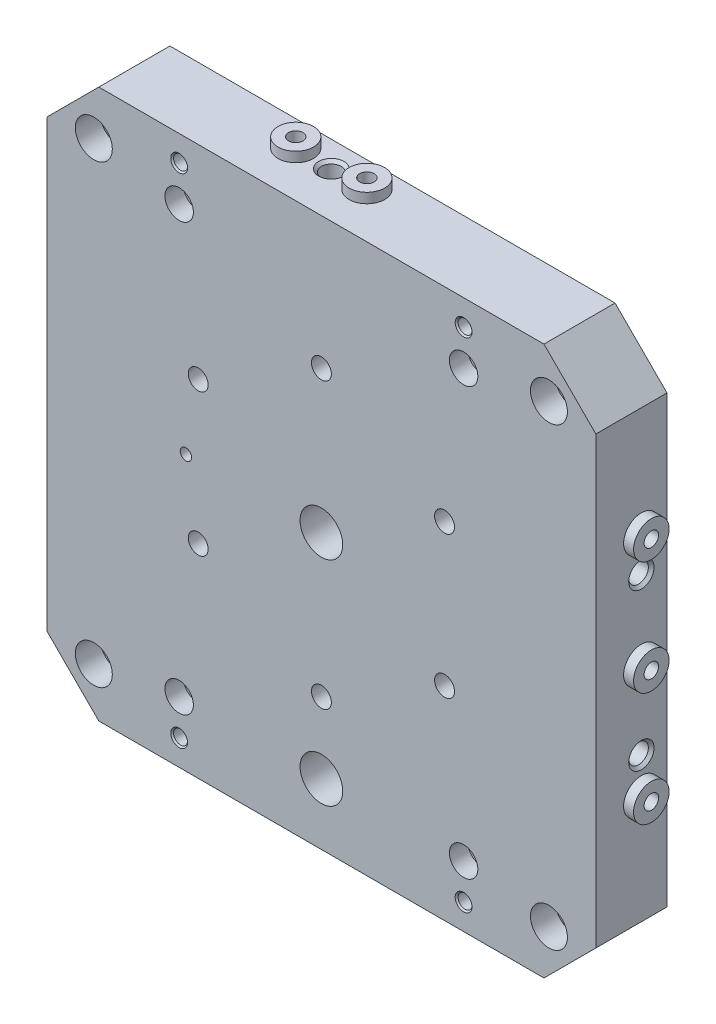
ISO-10303-21;
HEADER;
FILE_DESCRIPTION(('STEP AP214'),'2;1');
FILE_NAME('part.step','',(''),(''),'','','');
FILE_SCHEMA(('AUTOMOTIVE_DESIGN { 1 0 10303 214 1 1 1 1 }'));
ENDSEC;
DATA;
#1=APPLICATION_CONTEXT('core data for automotive mechanical design processes');
#2=APPLICATION_PROTOCOL_DEFINITION('international standard','automotive_design',2000,#1);
#3=PRODUCT_CONTEXT('',#1,'mechanical');
#4=PRODUCT('Part','Part','',(#3));
#5=PRODUCT_RELATED_PRODUCT_CATEGORY('part','',(#4));
#6=PRODUCT_DEFINITION_FORMATION('','',#4);
#7=PRODUCT_DEFINITION_CONTEXT('part definition',#1,'design');
#8=PRODUCT_DEFINITION('design','',#6,#7);
#9=PRODUCT_DEFINITION_SHAPE('','',#8);
#10=(LENGTH_UNIT() NAMED_UNIT(*) SI_UNIT(.MILLI.,.METRE.));
#11=(NAMED_UNIT(*) PLANE_ANGLE_UNIT() SI_UNIT($,.RADIAN.));
#12=(NAMED_UNIT(*) SI_UNIT($,.STERADIAN.) SOLID_ANGLE_UNIT());
#13=UNCERTAINTY_MEASURE_WITH_UNIT(LENGTH_MEASURE(1.E-05),#10,'distance_accuracy_value','');
#14=(GEOMETRIC_REPRESENTATION_CONTEXT(3) GLOBAL_UNCERTAINTY_ASSIGNED_CONTEXT((#13)) GLOBAL_UNIT_ASSIGNED_CONTEXT((#10,
#11,#12)) REPRESENTATION_CONTEXT('',''));
#15=CARTESIAN_POINT('',(0.,0.,0.));
#16=DIRECTION('',(0.,0.,1.));
#17=DIRECTION('',(1.,0.,0.));
#18=AXIS2_PLACEMENT_3D('',#15,#16,#17);
#19=CARTESIAN_POINT('',(193.,-156.5,50.));
#20=DIRECTION('',(-1.,0.,0.));
#21=DIRECTION('',(0.,0.,1.));
#22=AXIS2_PLACEMENT_3D('',#19,#20,#21);
#23=PLANE('',#22);
#24=CARTESIAN_POINT('',(193.,-55.,18.));
#25=DIRECTION('',(-1.,0.,0.));
#26=DIRECTION('',(0.,0.,1.));
#27=AXIS2_PLACEMENT_3D('',#24,#25,#26);
#28=CIRCLE('',#27,8.9175);
#29=CARTESIAN_POINT('',(193.,-55.,26.9175));
#30=VERTEX_POINT('',#29);
#31=EDGE_CURVE('E39',#30,#30,#28,.T.);
#32=ORIENTED_EDGE('',*,*,#31,.T.);
#33=EDGE_LOOP('',(#32));
#34=FACE_BOUND('',#33,.T.);
#35=CARTESIAN_POINT('',(193.,55.,18.));
#36=DIRECTION('',(-1.,0.,0.));
#37=DIRECTION('',(0.,0.,1.));
#38=AXIS2_PLACEMENT_3D('',#35,#36,#37);
#39=CIRCLE('',#38,8.9175);
#40=CARTESIAN_POINT('',(193.,55.,26.9175));
#41=VERTEX_POINT('',#40);
#42=EDGE_CURVE('E287',#41,#41,#39,.T.);
#43=ORIENTED_EDGE('',*,*,#42,.T.);
#44=EDGE_LOOP('',(#43));
#45=FACE_BOUND('',#44,.T.);
#46=CARTESIAN_POINT('',(193.,80.,18.));
#47=DIRECTION('',(-1.,0.,0.));
#48=DIRECTION('',(0.,0.,1.));
#49=AXIS2_PLACEMENT_3D('',#46,#47,#48);
#50=CIRCLE('',#49,12.5);
#51=CARTESIAN_POINT('',(193.,80.,30.5));
#52=VERTEX_POINT('',#51);
#53=EDGE_CURVE('E45',#52,#52,#50,.F.);
#54=ORIENTED_EDGE('',*,*,#53,.F.);
#55=EDGE_LOOP('',(#54));
#56=FACE_BOUND('',#55,.T.);
#57=DIRECTION('',(0.,1.,0.));
#58=VECTOR('',#57,1.);
#59=CARTESIAN_POINT('',(193.,-156.5,0.));
#60=LINE('',#59,#58);
#61=CARTESIAN_POINT('',(193.,-156.5,0.));
#62=VERTEX_POINT('',#61);
#63=CARTESIAN_POINT('',(193.,156.5,0.));
#64=VERTEX_POINT('',#63);
#65=EDGE_CURVE('E149',#62,#64,#60,.T.);
#66=ORIENTED_EDGE('',*,*,#65,.T.);
#67=DIRECTION('',(0.,0.,-1.));
#68=VECTOR('',#67,1.);
#69=CARTESIAN_POINT('',(193.,156.5,50.));
#70=LINE('',#69,#68);
#71=CARTESIAN_POINT('',(193.,156.5,50.));
#72=VERTEX_POINT('',#71);
#73=EDGE_CURVE('E129',#72,#64,#70,.T.);
#74=ORIENTED_EDGE('',*,*,#73,.F.);
#75=DIRECTION('',(0.,1.,0.));
#76=VECTOR('',#75,1.);
#77=CARTESIAN_POINT('',(193.,-156.5,50.));
#78=LINE('',#77,#76);
#79=CARTESIAN_POINT('',(193.,-156.5,50.));
#80=VERTEX_POINT('',#79);
#81=EDGE_CURVE('E120',#80,#72,#78,.T.);
#82=ORIENTED_EDGE('',*,*,#81,.F.);
#83=DIRECTION('',(0.,0.,-1.));
#84=VECTOR('',#83,1.);
#85=CARTESIAN_POINT('',(193.,-156.5,50.));
#86=LINE('',#85,#84);
#87=EDGE_CURVE('E158',#80,#62,#86,.T.);
#88=ORIENTED_EDGE('',*,*,#87,.T.);
#89=EDGE_LOOP('',(#66,#74,#82,#88));
#90=FACE_BOUND('',#89,.T.);
#91=CARTESIAN_POINT('',(193.,0.,18.));
#92=DIRECTION('',(-1.,0.,0.));
#93=DIRECTION('',(0.,0.,1.));
#94=AXIS2_PLACEMENT_3D('',#91,#92,#93);
#95=CIRCLE('',#94,12.5);
#96=CARTESIAN_POINT('',(193.,0.,30.5));
#97=VERTEX_POINT('',#96);
#98=EDGE_CURVE('E175',#97,#97,#95,.F.);
#99=ORIENTED_EDGE('',*,*,#98,.F.);
#100=EDGE_LOOP('',(#99));
#101=FACE_BOUND('',#100,.T.);
#102=CARTESIAN_POINT('',(193.,-80.,18.));
#103=DIRECTION('',(-1.,0.,0.));
#104=DIRECTION('',(0.,0.,1.));
#105=AXIS2_PLACEMENT_3D('',#102,#103,#104);
#106=CIRCLE('',#105,12.5);
#107=CARTESIAN_POINT('',(193.,-80.,30.5));
#108=VERTEX_POINT('',#107);
#109=EDGE_CURVE('E11',#108,#108,#106,.F.);
#110=ORIENTED_EDGE('',*,*,#109,.F.);
#111=EDGE_LOOP('',(#110));
#112=FACE_BOUND('',#111,.T.);
#113=ADVANCED_FACE('F35',(#34,#45,#56,#90,#101,#112),#23,.F.);
#114=CARTESIAN_POINT('',(156.5,193.,50.));
#115=DIRECTION('',(0.,-1.,0.));
#116=DIRECTION('',(0.,0.,-1.));
#117=AXIS2_PLACEMENT_3D('',#114,#115,#116);
#118=PLANE('',#117);
#119=CARTESIAN_POINT('',(-25.,193.,18.));
#120=DIRECTION('',(0.,-1.,0.));
#121=DIRECTION('',(0.,0.,-1.));
#122=AXIS2_PLACEMENT_3D('',#119,#120,#121);
#123=CIRCLE('',#122,8.9175);
#124=CARTESIAN_POINT('',(-25.,193.,9.0825));
#125=VERTEX_POINT('',#124);
#126=EDGE_CURVE('E279',#125,#125,#123,.T.);
#127=ORIENTED_EDGE('',*,*,#126,.T.);
#128=EDGE_LOOP('',(#127));
#129=FACE_BOUND('',#128,.T.);
#130=CARTESIAN_POINT('',(0.,193.,18.));
#131=DIRECTION('',(0.,-1.,0.));
#132=DIRECTION('',(0.,0.,-1.));
#133=AXIS2_PLACEMENT_3D('',#130,#131,#132);
#134=CIRCLE('',#133,12.5);
#135=CARTESIAN_POINT('',(0.,193.,5.5));
#136=VERTEX_POINT('',#135);
#137=EDGE_CURVE('E169',#136,#136,#134,.F.);
#138=ORIENTED_EDGE('',*,*,#137,.F.);
#139=EDGE_LOOP('',(#138));
#140=FACE_BOUND('',#139,.T.);
#141=DIRECTION('',(-1.,0.,0.));
#142=VECTOR('',#141,1.);
#143=CARTESIAN_POINT('',(156.5,193.,0.));
#144=LINE('',#143,#142);
#145=CARTESIAN_POINT('',(156.5,193.,0.));
#146=VERTEX_POINT('',#145);
#147=CARTESIAN_POINT('',(-156.5,193.,0.));
#148=VERTEX_POINT('',#147);
#149=EDGE_CURVE('E84',#146,#148,#144,.T.);
#150=ORIENTED_EDGE('',*,*,#149,.T.);
#151=DIRECTION('',(0.,0.,-1.));
#152=VECTOR('',#151,1.);
#153=CARTESIAN_POINT('',(-156.5,193.,50.));
#154=LINE('',#153,#152);
#155=CARTESIAN_POINT('',(-156.5,193.,50.));
#156=VERTEX_POINT('',#155);
#157=EDGE_CURVE('E130',#156,#148,#154,.T.);
#158=ORIENTED_EDGE('',*,*,#157,.F.);
#159=DIRECTION('',(-1.,0.,0.));
#160=VECTOR('',#159,1.);
#161=CARTESIAN_POINT('',(156.5,193.,50.));
#162=LINE('',#161,#160);
#163=CARTESIAN_POINT('',(156.5,193.,50.));
#164=VERTEX_POINT('',#163);
#165=EDGE_CURVE('E118',#164,#156,#162,.T.);
#166=ORIENTED_EDGE('',*,*,#165,.F.);
#167=DIRECTION('',(0.,0.,-1.));
#168=VECTOR('',#167,1.);
#169=CARTESIAN_POINT('',(156.5,193.,50.));
#170=LINE('',#169,#168);
#171=EDGE_CURVE('E125',#164,#146,#170,.T.);
#172=ORIENTED_EDGE('',*,*,#171,.T.);
#173=EDGE_LOOP('',(#150,#158,#166,#172));
#174=FACE_BOUND('',#173,.T.);
#175=CARTESIAN_POINT('',(-50.,193.,18.));
#176=DIRECTION('',(0.,-1.,0.));
#177=DIRECTION('',(0.,0.,-1.));
#178=AXIS2_PLACEMENT_3D('',#175,#176,#177);
#179=CIRCLE('',#178,12.5);
#180=CARTESIAN_POINT('',(-50.,193.,5.50000000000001));
#181=VERTEX_POINT('',#180);
#182=EDGE_CURVE('E172',#181,#181,#179,.F.);
#183=ORIENTED_EDGE('',*,*,#182,.F.);
#184=EDGE_LOOP('',(#183));
#185=FACE_BOUND('',#184,.T.);
#186=ADVANCED_FACE('F132',(#129,#140,#174,#185),#118,.F.);
#187=CARTESIAN_POINT('',(-193.,156.5,50.));
#188=DIRECTION('',(1.,0.,0.));
#189=DIRECTION('',(0.,0.,-1.));
#190=AXIS2_PLACEMENT_3D('',#187,#188,#189);
#191=PLANE('',#190);
#192=DIRECTION('',(0.,-1.,0.));
#193=VECTOR('',#192,1.);
#194=CARTESIAN_POINT('',(-193.,156.5,0.));
#195=LINE('',#194,#193);
#196=CARTESIAN_POINT('',(-193.,156.5,0.));
#197=VERTEX_POINT('',#196);
#198=CARTESIAN_POINT('',(-193.,-156.5,0.));
#199=VERTEX_POINT('',#198);
#200=EDGE_CURVE('E139',#197,#199,#195,.T.);
#201=ORIENTED_EDGE('',*,*,#200,.T.);
#202=DIRECTION('',(0.,0.,-1.));
#203=VECTOR('',#202,1.);
#204=CARTESIAN_POINT('',(-193.,-156.5,50.));
#205=LINE('',#204,#203);
#206=CARTESIAN_POINT('',(-193.,-156.5,50.));
#207=VERTEX_POINT('',#206);
#208=EDGE_CURVE('E167',#207,#199,#205,.T.);
#209=ORIENTED_EDGE('',*,*,#208,.F.);
#210=DIRECTION('',(0.,-1.,0.));
#211=VECTOR('',#210,1.);
#212=CARTESIAN_POINT('',(-193.,156.5,50.));
#213=LINE('',#212,#211);
#214=CARTESIAN_POINT('',(-193.,156.5,50.));
#215=VERTEX_POINT('',#214);
#216=EDGE_CURVE('E154',#215,#207,#213,.T.);
#217=ORIENTED_EDGE('',*,*,#216,.F.);
#218=DIRECTION('',(0.,0.,-1.));
#219=VECTOR('',#218,1.);
#220=CARTESIAN_POINT('',(-193.,156.5,50.));
#221=LINE('',#220,#219);
#222=EDGE_CURVE('E135',#215,#197,#221,.T.);
#223=ORIENTED_EDGE('',*,*,#222,.T.);
#224=EDGE_LOOP('',(#201,#209,#217,#223));
#225=FACE_BOUND('',#224,.T.);
#226=ADVANCED_FACE('F37',(#225),#191,.F.);
#227=CARTESIAN_POINT('',(-193.,-156.5,50.));
#228=DIRECTION('',(0.707106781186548,0.707106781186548,0.));
#229=DIRECTION('',(-0.707106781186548,0.707106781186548,0.));
#230=AXIS2_PLACEMENT_3D('',#227,#228,#229);
#231=PLANE('',#230);
#232=DIRECTION('',(0.707106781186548,-0.707106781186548,0.));
#233=VECTOR('',#232,1.);
#234=CARTESIAN_POINT('',(-193.,-156.5,0.));
#235=LINE('',#234,#233);
#236=CARTESIAN_POINT('',(-156.5,-193.,0.));
#237=VERTEX_POINT('',#236);
#238=EDGE_CURVE('E142',#199,#237,#235,.T.);
#239=ORIENTED_EDGE('',*,*,#238,.T.);
#240=DIRECTION('',(0.,0.,-1.));
#241=VECTOR('',#240,1.);
#242=CARTESIAN_POINT('',(-156.5,-193.,50.));
#243=LINE('',#242,#241);
#244=CARTESIAN_POINT('',(-156.5,-193.,50.));
#245=VERTEX_POINT('',#244);
#246=EDGE_CURVE('E164',#245,#237,#243,.T.);
#247=ORIENTED_EDGE('',*,*,#246,.F.);
#248=DIRECTION('',(0.707106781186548,-0.707106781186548,0.));
#249=VECTOR('',#248,1.);
#250=CARTESIAN_POINT('',(-193.,-156.5,50.));
#251=LINE('',#250,#249);
#252=EDGE_CURVE('E99',#207,#245,#251,.T.);
#253=ORIENTED_EDGE('',*,*,#252,.F.);
#254=ORIENTED_EDGE('',*,*,#208,.T.);
#255=EDGE_LOOP('',(#239,#247,#253,#254));
#256=FACE_BOUND('',#255,.T.);
#257=ADVANCED_FACE('F420',(#256),#231,.F.);
#258=CARTESIAN_POINT('',(-156.5,-193.,50.));
#259=DIRECTION('',(0.,1.,0.));
#260=DIRECTION('',(0.,0.,1.));
#261=AXIS2_PLACEMENT_3D('',#258,#259,#260);
#262=PLANE('',#261);
#263=DIRECTION('',(1.,0.,0.));
#264=VECTOR('',#263,1.);
#265=CARTESIAN_POINT('',(-156.5,-193.,0.));
#266=LINE('',#265,#264);
#267=CARTESIAN_POINT('',(156.5,-193.,0.));
#268=VERTEX_POINT('',#267);
#269=EDGE_CURVE('E145',#237,#268,#266,.T.);
#270=ORIENTED_EDGE('',*,*,#269,.T.);
#271=DIRECTION('',(0.,0.,-1.));
#272=VECTOR('',#271,1.);
#273=CARTESIAN_POINT('',(156.5,-193.,50.));
#274=LINE('',#273,#272);
#275=CARTESIAN_POINT('',(156.5,-193.,50.));
#276=VERTEX_POINT('',#275);
#277=EDGE_CURVE('E161',#276,#268,#274,.T.);
#278=ORIENTED_EDGE('',*,*,#277,.F.);
#279=DIRECTION('',(1.,0.,0.));
#280=VECTOR('',#279,1.);
#281=CARTESIAN_POINT('',(-156.5,-193.,50.));
#282=LINE('',#281,#280);
#283=EDGE_CURVE('E374',#245,#276,#282,.T.);
#284=ORIENTED_EDGE('',*,*,#283,.F.);
#285=ORIENTED_EDGE('',*,*,#246,.T.);
#286=EDGE_LOOP('',(#270,#278,#284,#285));
#287=FACE_BOUND('',#286,.T.);
#288=ADVANCED_FACE('F418',(#287),#262,.F.);
#289=CARTESIAN_POINT('',(156.5,-193.,50.));
#290=DIRECTION('',(-0.707106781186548,0.707106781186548,0.));
#291=DIRECTION('',(-0.707106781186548,-0.707106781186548,0.));
#292=AXIS2_PLACEMENT_3D('',#289,#290,#291);
#293=PLANE('',#292);
#294=DIRECTION('',(0.707106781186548,0.707106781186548,0.));
#295=VECTOR('',#294,1.);
#296=CARTESIAN_POINT('',(156.5,-193.,0.));
#297=LINE('',#296,#295);
#298=EDGE_CURVE('E147',#268,#62,#297,.T.);
#299=ORIENTED_EDGE('',*,*,#298,.T.);
#300=ORIENTED_EDGE('',*,*,#87,.F.);
#301=DIRECTION('',(0.707106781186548,0.707106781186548,0.));
#302=VECTOR('',#301,1.);
#303=CARTESIAN_POINT('',(156.5,-193.,50.));
#304=LINE('',#303,#302);
#305=EDGE_CURVE('E376',#276,#80,#304,.T.);
#306=ORIENTED_EDGE('',*,*,#305,.F.);
#307=ORIENTED_EDGE('',*,*,#277,.T.);
#308=EDGE_LOOP('',(#299,#300,#306,#307));
#309=FACE_BOUND('',#308,.T.);
#310=ADVANCED_FACE('F382',(#309),#293,.F.);
#311=CARTESIAN_POINT('',(193.,156.5,50.));
#312=DIRECTION('',(-0.707106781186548,-0.707106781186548,0.));
#313=DIRECTION('',(0.707106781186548,-0.707106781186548,0.));
#314=AXIS2_PLACEMENT_3D('',#311,#312,#313);
#315=PLANE('',#314);
#316=DIRECTION('',(-0.707106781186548,0.707106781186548,0.));
#317=VECTOR('',#316,1.);
#318=CARTESIAN_POINT('',(193.,156.5,0.));
#319=LINE('',#318,#317);
#320=EDGE_CURVE('E128',#64,#146,#319,.T.);
#321=ORIENTED_EDGE('',*,*,#320,.T.);
#322=ORIENTED_EDGE('',*,*,#171,.F.);
#323=DIRECTION('',(-0.707106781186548,0.707106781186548,0.));
#324=VECTOR('',#323,1.);
#325=CARTESIAN_POINT('',(193.,156.5,50.));
#326=LINE('',#325,#324);
#327=EDGE_CURVE('E114',#72,#164,#326,.T.);
#328=ORIENTED_EDGE('',*,*,#327,.F.);
#329=ORIENTED_EDGE('',*,*,#73,.T.);
#330=EDGE_LOOP('',(#321,#322,#328,#329));
#331=FACE_BOUND('',#330,.T.);
#332=ADVANCED_FACE('F126',(#331),#315,.F.);
#333=CARTESIAN_POINT('',(-156.5,193.,50.));
#334=DIRECTION('',(0.707106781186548,-0.707106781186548,0.));
#335=DIRECTION('',(0.707106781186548,0.707106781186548,0.));
#336=AXIS2_PLACEMENT_3D('',#333,#334,#335);
#337=PLANE('',#336);
#338=DIRECTION('',(-0.707106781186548,-0.707106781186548,0.));
#339=VECTOR('',#338,1.);
#340=CARTESIAN_POINT('',(-156.5,193.,0.));
#341=LINE('',#340,#339);
#342=EDGE_CURVE('E90',#148,#197,#341,.T.);
#343=ORIENTED_EDGE('',*,*,#342,.T.);
#344=ORIENTED_EDGE('',*,*,#222,.F.);
#345=DIRECTION('',(-0.707106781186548,-0.707106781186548,0.));
#346=VECTOR('',#345,1.);
#347=CARTESIAN_POINT('',(-156.5,193.,50.));
#348=LINE('',#347,#346);
#349=EDGE_CURVE('E54',#156,#215,#348,.T.);
#350=ORIENTED_EDGE('',*,*,#349,.F.);
#351=ORIENTED_EDGE('',*,*,#157,.T.);
#352=EDGE_LOOP('',(#343,#344,#350,#351));
#353=FACE_BOUND('',#352,.T.);
#354=ADVANCED_FACE('F394',(#353),#337,.F.);
#355=CARTESIAN_POINT('',(-193.,-193.,50.));
#356=DIRECTION('',(0.,0.,1.));
#357=DIRECTION('',(1.,0.,0.));
#358=AXIS2_PLACEMENT_3D('',#355,#356,#357);
#359=PLANE('',#358);
#360=CARTESIAN_POINT('',(-95.25,0.,50.));
#361=DIRECTION('',(0.,0.,1.));
#362=DIRECTION('',(1.,0.,0.));
#363=AXIS2_PLACEMENT_3D('',#360,#361,#362);
#364=CIRCLE('',#363,3.99999999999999);
#365=CARTESIAN_POINT('',(-91.25,0.,50.));
#366=VERTEX_POINT('',#365);
#367=EDGE_CURVE('E1499',#366,#366,#364,.T.);
#368=ORIENTED_EDGE('',*,*,#367,.F.);
#369=EDGE_LOOP('',(#368));
#370=FACE_BOUND('',#369,.T.);
#371=CARTESIAN_POINT('',(-86.6025403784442,49.9999999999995,50.));
#372=DIRECTION('',(0.,0.,1.));
#373=DIRECTION('',(1.,0.,0.));
#374=AXIS2_PLACEMENT_3D('',#371,#372,#373);
#375=CIRCLE('',#374,6.99999999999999);
#376=CARTESIAN_POINT('',(-79.6025403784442,49.9999999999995,50.));
#377=VERTEX_POINT('',#376);
#378=EDGE_CURVE('E1493',#377,#377,#375,.T.);
#379=ORIENTED_EDGE('',*,*,#378,.F.);
#380=EDGE_LOOP('',(#379));
#381=FACE_BOUND('',#380,.T.);
#382=CARTESIAN_POINT('',(86.6025403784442,49.9999999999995,50.));
#383=DIRECTION('',(0.,0.,1.));
#384=DIRECTION('',(1.,0.,0.));
#385=AXIS2_PLACEMENT_3D('',#382,#383,#384);
#386=CIRCLE('',#385,6.99999999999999);
#387=CARTESIAN_POINT('',(93.6025403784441,49.9999999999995,50.));
#388=VERTEX_POINT('',#387);
#389=EDGE_CURVE('E1487',#388,#388,#386,.T.);
#390=ORIENTED_EDGE('',*,*,#389,.F.);
#391=EDGE_LOOP('',(#390));
#392=FACE_BOUND('',#391,.T.);
#393=CARTESIAN_POINT('',(86.6025403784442,-49.9999999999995,50.));
#394=DIRECTION('',(0.,0.,1.));
#395=DIRECTION('',(1.,0.,0.));
#396=AXIS2_PLACEMENT_3D('',#393,#394,#395);
#397=CIRCLE('',#396,6.99999999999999);
#398=CARTESIAN_POINT('',(93.6025403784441,-49.9999999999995,50.));
#399=VERTEX_POINT('',#398);
#400=EDGE_CURVE('E1481',#399,#399,#397,.T.);
#401=ORIENTED_EDGE('',*,*,#400,.F.);
#402=EDGE_LOOP('',(#401));
#403=FACE_BOUND('',#402,.T.);
#404=CARTESIAN_POINT('',(-86.6025403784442,-49.9999999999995,50.));
#405=DIRECTION('',(0.,0.,1.));
#406=DIRECTION('',(1.,0.,0.));
#407=AXIS2_PLACEMENT_3D('',#404,#405,#406);
#408=CIRCLE('',#407,6.99999999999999);
#409=CARTESIAN_POINT('',(-79.6025403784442,-49.9999999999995,50.));
#410=VERTEX_POINT('',#409);
#411=EDGE_CURVE('E1475',#410,#410,#408,.T.);
#412=ORIENTED_EDGE('',*,*,#411,.F.);
#413=EDGE_LOOP('',(#412));
#414=FACE_BOUND('',#413,.T.);
#415=CARTESIAN_POINT('',(0.,-100.,50.));
#416=DIRECTION('',(0.,0.,1.));
#417=DIRECTION('',(1.,0.,0.));
#418=AXIS2_PLACEMENT_3D('',#415,#416,#417);
#419=CIRCLE('',#418,6.99999999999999);
#420=CARTESIAN_POINT('',(6.99999999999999,-100.,50.));
#421=VERTEX_POINT('',#420);
#422=EDGE_CURVE('E1469',#421,#421,#419,.T.);
#423=ORIENTED_EDGE('',*,*,#422,.F.);
#424=EDGE_LOOP('',(#423));
#425=FACE_BOUND('',#424,.T.);
#426=CARTESIAN_POINT('',(0.,100.,50.));
#427=DIRECTION('',(0.,0.,1.));
#428=DIRECTION('',(1.,0.,0.));
#429=AXIS2_PLACEMENT_3D('',#426,#427,#428);
#430=CIRCLE('',#429,6.99999999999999);
#431=CARTESIAN_POINT('',(6.99999999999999,100.,50.));
#432=VERTEX_POINT('',#431);
#433=EDGE_CURVE('E1461',#432,#432,#430,.T.);
#434=ORIENTED_EDGE('',*,*,#433,.F.);
#435=EDGE_LOOP('',(#434));
#436=FACE_BOUND('',#435,.T.);
#437=CARTESIAN_POINT('',(100.,-175.,50.));
#438=DIRECTION('',(0.,0.,1.));
#439=DIRECTION('',(1.,0.,0.));
#440=AXIS2_PLACEMENT_3D('',#437,#438,#439);
#441=CIRCLE('',#440,5.917);
#442=CARTESIAN_POINT('',(105.917,-175.,50.));
#443=VERTEX_POINT('',#442);
#444=EDGE_CURVE('E274',#443,#443,#441,.T.);
#445=ORIENTED_EDGE('',*,*,#444,.F.);
#446=EDGE_LOOP('',(#445));
#447=FACE_BOUND('',#446,.T.);
#448=CARTESIAN_POINT('',(-100.,-175.,50.));
#449=DIRECTION('',(0.,0.,1.));
#450=DIRECTION('',(1.,0.,0.));
#451=AXIS2_PLACEMENT_3D('',#448,#449,#450);
#452=CIRCLE('',#451,5.91700000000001);
#453=CARTESIAN_POINT('',(-94.083,-175.,50.));
#454=VERTEX_POINT('',#453);
#455=EDGE_CURVE('E266',#454,#454,#452,.T.);
#456=ORIENTED_EDGE('',*,*,#455,.F.);
#457=EDGE_LOOP('',(#456));
#458=FACE_BOUND('',#457,.T.);
#459=CARTESIAN_POINT('',(100.,175.,50.));
#460=DIRECTION('',(0.,0.,1.));
#461=DIRECTION('',(1.,0.,0.));
#462=AXIS2_PLACEMENT_3D('',#459,#460,#461);
#463=CIRCLE('',#462,5.917);
#464=CARTESIAN_POINT('',(105.917,175.,50.));
#465=VERTEX_POINT('',#464);
#466=EDGE_CURVE('E258',#465,#465,#463,.T.);
#467=ORIENTED_EDGE('',*,*,#466,.F.);
#468=EDGE_LOOP('',(#467));
#469=FACE_BOUND('',#468,.T.);
#470=CARTESIAN_POINT('',(-100.,175.,50.));
#471=DIRECTION('',(0.,0.,1.));
#472=DIRECTION('',(1.,0.,0.));
#473=AXIS2_PLACEMENT_3D('',#470,#471,#472);
#474=CIRCLE('',#473,5.91700000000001);
#475=CARTESIAN_POINT('',(-94.083,175.,50.));
#476=VERTEX_POINT('',#475);
#477=EDGE_CURVE('E250',#476,#476,#474,.T.);
#478=ORIENTED_EDGE('',*,*,#477,.F.);
#479=EDGE_LOOP('',(#478));
#480=FACE_BOUND('',#479,.T.);
#481=CARTESIAN_POINT('',(-100.,-150.,50.));
#482=DIRECTION('',(0.,0.,1.));
#483=DIRECTION('',(1.,0.,0.));
#484=AXIS2_PLACEMENT_3D('',#481,#482,#483);
#485=CIRCLE('',#484,9.99999999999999);
#486=CARTESIAN_POINT('',(-90.,-150.,50.));
#487=VERTEX_POINT('',#486);
#488=EDGE_CURVE('E242',#487,#487,#485,.T.);
#489=ORIENTED_EDGE('',*,*,#488,.F.);
#490=EDGE_LOOP('',(#489));
#491=FACE_BOUND('',#490,.T.);
#492=CARTESIAN_POINT('',(100.,-150.,50.));
#493=DIRECTION('',(0.,0.,1.));
#494=DIRECTION('',(1.,0.,0.));
#495=AXIS2_PLACEMENT_3D('',#492,#493,#494);
#496=CIRCLE('',#495,10.);
#497=CARTESIAN_POINT('',(110.,-150.,50.));
#498=VERTEX_POINT('',#497);
#499=EDGE_CURVE('E234',#498,#498,#496,.T.);
#500=ORIENTED_EDGE('',*,*,#499,.F.);
#501=EDGE_LOOP('',(#500));
#502=FACE_BOUND('',#501,.T.);
#503=CARTESIAN_POINT('',(-100.,150.,50.));
#504=DIRECTION('',(0.,0.,1.));
#505=DIRECTION('',(1.,0.,0.));
#506=AXIS2_PLACEMENT_3D('',#503,#504,#505);
#507=CIRCLE('',#506,9.99999999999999);
#508=CARTESIAN_POINT('',(-90.,150.,50.));
#509=VERTEX_POINT('',#508);
#510=EDGE_CURVE('E226',#509,#509,#507,.T.);
#511=ORIENTED_EDGE('',*,*,#510,.F.);
#512=EDGE_LOOP('',(#511));
#513=FACE_BOUND('',#512,.T.);
#514=CARTESIAN_POINT('',(100.,150.,50.));
#515=DIRECTION('',(0.,0.,1.));
#516=DIRECTION('',(1.,0.,0.));
#517=AXIS2_PLACEMENT_3D('',#514,#515,#516);
#518=CIRCLE('',#517,10.);
#519=CARTESIAN_POINT('',(110.,150.,50.));
#520=VERTEX_POINT('',#519);
#521=EDGE_CURVE('E216',#520,#520,#518,.T.);
#522=ORIENTED_EDGE('',*,*,#521,.F.);
#523=EDGE_LOOP('',(#522));
#524=FACE_BOUND('',#523,.T.);
#525=CARTESIAN_POINT('',(0.,-150.,50.));
#526=DIRECTION('',(0.,0.,1.));
#527=DIRECTION('',(1.,0.,0.));
#528=AXIS2_PLACEMENT_3D('',#525,#526,#527);
#529=CIRCLE('',#528,15.);
#530=CARTESIAN_POINT('',(15.,-150.,50.));
#531=VERTEX_POINT('',#530);
#532=EDGE_CURVE('E212',#531,#531,#529,.T.);
#533=ORIENTED_EDGE('',*,*,#532,.F.);
#534=EDGE_LOOP('',(#533));
#535=FACE_BOUND('',#534,.T.);
#536=CARTESIAN_POINT('',(0.,0.,50.));
#537=DIRECTION('',(0.,0.,1.));
#538=DIRECTION('',(1.,0.,0.));
#539=AXIS2_PLACEMENT_3D('',#536,#537,#538);
#540=CIRCLE('',#539,15.);
#541=CARTESIAN_POINT('',(15.,0.,50.));
#542=VERTEX_POINT('',#541);
#543=EDGE_CURVE('E211',#542,#542,#540,.T.);
#544=ORIENTED_EDGE('',*,*,#543,.F.);
#545=EDGE_LOOP('',(#544));
#546=FACE_BOUND('',#545,.T.);
#547=CARTESIAN_POINT('',(-160.,-160.,50.));
#548=DIRECTION('',(0.,0.,1.));
#549=DIRECTION('',(1.,0.,0.));
#550=AXIS2_PLACEMENT_3D('',#547,#548,#549);
#551=CIRCLE('',#550,13.);
#552=CARTESIAN_POINT('',(-147.,-160.,50.));
#553=VERTEX_POINT('',#552);
#554=EDGE_CURVE('E203',#553,#553,#551,.T.);
#555=ORIENTED_EDGE('',*,*,#554,.F.);
#556=EDGE_LOOP('',(#555));
#557=FACE_BOUND('',#556,.T.);
#558=CARTESIAN_POINT('',(160.,-160.,50.));
#559=DIRECTION('',(0.,0.,1.));
#560=DIRECTION('',(1.,0.,0.));
#561=AXIS2_PLACEMENT_3D('',#558,#559,#560);
#562=CIRCLE('',#561,13.);
#563=CARTESIAN_POINT('',(173.,-160.,50.));
#564=VERTEX_POINT('',#563);
#565=EDGE_CURVE('E195',#564,#564,#562,.T.);
#566=ORIENTED_EDGE('',*,*,#565,.F.);
#567=EDGE_LOOP('',(#566));
#568=FACE_BOUND('',#567,.T.);
#569=CARTESIAN_POINT('',(160.,160.,50.));
#570=DIRECTION('',(0.,0.,1.));
#571=DIRECTION('',(1.,0.,0.));
#572=AXIS2_PLACEMENT_3D('',#569,#570,#571);
#573=CIRCLE('',#572,13.);
#574=CARTESIAN_POINT('',(173.,160.,50.));
#575=VERTEX_POINT('',#574);
#576=EDGE_CURVE('E187',#575,#575,#573,.T.);
#577=ORIENTED_EDGE('',*,*,#576,.F.);
#578=EDGE_LOOP('',(#577));
#579=FACE_BOUND('',#578,.T.);
#580=CARTESIAN_POINT('',(-160.,160.,50.));
#581=DIRECTION('',(0.,0.,1.));
#582=DIRECTION('',(1.,0.,0.));
#583=AXIS2_PLACEMENT_3D('',#580,#581,#582);
#584=CIRCLE('',#583,13.);
#585=CARTESIAN_POINT('',(-147.,160.,50.));
#586=VERTEX_POINT('',#585);
#587=EDGE_CURVE('E179',#586,#586,#584,.T.);
#588=ORIENTED_EDGE('',*,*,#587,.F.);
#589=EDGE_LOOP('',(#588));
#590=FACE_BOUND('',#589,.T.);
#591=ORIENTED_EDGE('',*,*,#216,.T.);
#592=ORIENTED_EDGE('',*,*,#252,.T.);
#593=ORIENTED_EDGE('',*,*,#283,.T.);
#594=ORIENTED_EDGE('',*,*,#305,.T.);
#595=ORIENTED_EDGE('',*,*,#81,.T.);
#596=ORIENTED_EDGE('',*,*,#327,.T.);
#597=ORIENTED_EDGE('',*,*,#165,.T.);
#598=ORIENTED_EDGE('',*,*,#349,.T.);
#599=EDGE_LOOP('',(#591,#592,#593,#594,#595,#596,#597,#598));
#600=FACE_BOUND('',#599,.T.);
#601=ADVANCED_FACE('F116',(#370,#381,#392,#403,#414,#425,#436,#447,#458,#469,#480,#491,#502,
#513,#524,#535,#546,#557,#568,#579,#590,#600),#359,.T.);
#602=CARTESIAN_POINT('',(-193.,-193.,0.));
#603=DIRECTION('',(0.,0.,1.));
#604=DIRECTION('',(1.,0.,0.));
#605=AXIS2_PLACEMENT_3D('',#602,#603,#604);
#606=PLANE('',#605);
#607=CARTESIAN_POINT('',(-95.25,0.,0.));
#608=DIRECTION('',(0.,0.,1.));
#609=DIRECTION('',(1.,0.,0.));
#610=AXIS2_PLACEMENT_3D('',#607,#608,#609);
#611=CIRCLE('',#610,3.99999999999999);
#612=CARTESIAN_POINT('',(-91.25,0.,0.));
#613=VERTEX_POINT('',#612);
#614=EDGE_CURVE('E1496',#613,#613,#611,.T.);
#615=ORIENTED_EDGE('',*,*,#614,.T.);
#616=EDGE_LOOP('',(#615));
#617=FACE_BOUND('',#616,.T.);
#618=CARTESIAN_POINT('',(-86.6025403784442,49.9999999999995,0.));
#619=DIRECTION('',(0.,0.,1.));
#620=DIRECTION('',(1.,0.,0.));
#621=AXIS2_PLACEMENT_3D('',#618,#619,#620);
#622=CIRCLE('',#621,6.99999999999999);
#623=CARTESIAN_POINT('',(-79.6025403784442,49.9999999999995,0.));
#624=VERTEX_POINT('',#623);
#625=EDGE_CURVE('E1490',#624,#624,#622,.T.);
#626=ORIENTED_EDGE('',*,*,#625,.T.);
#627=EDGE_LOOP('',(#626));
#628=FACE_BOUND('',#627,.T.);
#629=CARTESIAN_POINT('',(86.6025403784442,49.9999999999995,0.));
#630=DIRECTION('',(0.,0.,1.));
#631=DIRECTION('',(1.,0.,0.));
#632=AXIS2_PLACEMENT_3D('',#629,#630,#631);
#633=CIRCLE('',#632,6.99999999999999);
#634=CARTESIAN_POINT('',(93.6025403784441,49.9999999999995,0.));
#635=VERTEX_POINT('',#634);
#636=EDGE_CURVE('E1484',#635,#635,#633,.T.);
#637=ORIENTED_EDGE('',*,*,#636,.T.);
#638=EDGE_LOOP('',(#637));
#639=FACE_BOUND('',#638,.T.);
#640=CARTESIAN_POINT('',(86.6025403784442,-49.9999999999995,0.));
#641=DIRECTION('',(0.,0.,1.));
#642=DIRECTION('',(1.,0.,0.));
#643=AXIS2_PLACEMENT_3D('',#640,#641,#642);
#644=CIRCLE('',#643,6.99999999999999);
#645=CARTESIAN_POINT('',(93.6025403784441,-49.9999999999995,0.));
#646=VERTEX_POINT('',#645);
#647=EDGE_CURVE('E1478',#646,#646,#644,.T.);
#648=ORIENTED_EDGE('',*,*,#647,.T.);
#649=EDGE_LOOP('',(#648));
#650=FACE_BOUND('',#649,.T.);
#651=CARTESIAN_POINT('',(-86.6025403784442,-49.9999999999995,0.));
#652=DIRECTION('',(0.,0.,1.));
#653=DIRECTION('',(1.,0.,0.));
#654=AXIS2_PLACEMENT_3D('',#651,#652,#653);
#655=CIRCLE('',#654,6.99999999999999);
#656=CARTESIAN_POINT('',(-79.6025403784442,-49.9999999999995,0.));
#657=VERTEX_POINT('',#656);
#658=EDGE_CURVE('E1472',#657,#657,#655,.T.);
#659=ORIENTED_EDGE('',*,*,#658,.T.);
#660=EDGE_LOOP('',(#659));
#661=FACE_BOUND('',#660,.T.);
#662=CARTESIAN_POINT('',(0.,-100.,0.));
#663=DIRECTION('',(0.,0.,1.));
#664=DIRECTION('',(1.,0.,0.));
#665=AXIS2_PLACEMENT_3D('',#662,#663,#664);
#666=CIRCLE('',#665,6.99999999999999);
#667=CARTESIAN_POINT('',(6.99999999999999,-100.,0.));
#668=VERTEX_POINT('',#667);
#669=EDGE_CURVE('E1466',#668,#668,#666,.T.);
#670=ORIENTED_EDGE('',*,*,#669,.T.);
#671=EDGE_LOOP('',(#670));
#672=FACE_BOUND('',#671,.T.);
#673=CARTESIAN_POINT('',(0.,100.,0.));
#674=DIRECTION('',(0.,0.,1.));
#675=DIRECTION('',(1.,0.,0.));
#676=AXIS2_PLACEMENT_3D('',#673,#674,#675);
#677=CIRCLE('',#676,6.99999999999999);
#678=CARTESIAN_POINT('',(6.99999999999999,100.,0.));
#679=VERTEX_POINT('',#678);
#680=EDGE_CURVE('E1459',#679,#679,#677,.T.);
#681=ORIENTED_EDGE('',*,*,#680,.T.);
#682=EDGE_LOOP('',(#681));
#683=FACE_BOUND('',#682,.T.);
#684=CARTESIAN_POINT('',(100.,-175.,0.));
#685=DIRECTION('',(0.,0.,1.));
#686=DIRECTION('',(1.,0.,0.));
#687=AXIS2_PLACEMENT_3D('',#684,#685,#686);
#688=CIRCLE('',#687,5.917);
#689=CARTESIAN_POINT('',(105.917,-175.,0.));
#690=VERTEX_POINT('',#689);
#691=EDGE_CURVE('E271',#690,#690,#688,.T.);
#692=ORIENTED_EDGE('',*,*,#691,.T.);
#693=EDGE_LOOP('',(#692));
#694=FACE_BOUND('',#693,.T.);
#695=CARTESIAN_POINT('',(-100.,-175.,0.));
#696=DIRECTION('',(0.,0.,1.));
#697=DIRECTION('',(1.,0.,0.));
#698=AXIS2_PLACEMENT_3D('',#695,#696,#697);
#699=CIRCLE('',#698,5.917);
#700=CARTESIAN_POINT('',(-94.083,-175.,0.));
#701=VERTEX_POINT('',#700);
#702=EDGE_CURVE('E263',#701,#701,#699,.T.);
#703=ORIENTED_EDGE('',*,*,#702,.T.);
#704=EDGE_LOOP('',(#703));
#705=FACE_BOUND('',#704,.T.);
#706=CARTESIAN_POINT('',(100.,175.,0.));
#707=DIRECTION('',(0.,0.,1.));
#708=DIRECTION('',(1.,0.,0.));
#709=AXIS2_PLACEMENT_3D('',#706,#707,#708);
#710=CIRCLE('',#709,5.917);
#711=CARTESIAN_POINT('',(105.917,175.,0.));
#712=VERTEX_POINT('',#711);
#713=EDGE_CURVE('E255',#712,#712,#710,.T.);
#714=ORIENTED_EDGE('',*,*,#713,.T.);
#715=EDGE_LOOP('',(#714));
#716=FACE_BOUND('',#715,.T.);
#717=CARTESIAN_POINT('',(-100.,175.,0.));
#718=DIRECTION('',(0.,0.,1.));
#719=DIRECTION('',(1.,0.,0.));
#720=AXIS2_PLACEMENT_3D('',#717,#718,#719);
#721=CIRCLE('',#720,5.917);
#722=CARTESIAN_POINT('',(-94.083,175.,0.));
#723=VERTEX_POINT('',#722);
#724=EDGE_CURVE('E247',#723,#723,#721,.T.);
#725=ORIENTED_EDGE('',*,*,#724,.T.);
#726=EDGE_LOOP('',(#725));
#727=FACE_BOUND('',#726,.T.);
#728=CARTESIAN_POINT('',(-100.,-150.,0.));
#729=DIRECTION('',(0.,0.,1.));
#730=DIRECTION('',(1.,0.,0.));
#731=AXIS2_PLACEMENT_3D('',#728,#729,#730);
#732=CIRCLE('',#731,6.74999999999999);
#733=CARTESIAN_POINT('',(-93.25,-150.,0.));
#734=VERTEX_POINT('',#733);
#735=EDGE_CURVE('E239',#734,#734,#732,.T.);
#736=ORIENTED_EDGE('',*,*,#735,.T.);
#737=EDGE_LOOP('',(#736));
#738=FACE_BOUND('',#737,.T.);
#739=CARTESIAN_POINT('',(100.,-150.,0.));
#740=DIRECTION('',(0.,0.,1.));
#741=DIRECTION('',(1.,0.,0.));
#742=AXIS2_PLACEMENT_3D('',#739,#740,#741);
#743=CIRCLE('',#742,6.75000000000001);
#744=CARTESIAN_POINT('',(106.75,-150.,0.));
#745=VERTEX_POINT('',#744);
#746=EDGE_CURVE('E231',#745,#745,#743,.T.);
#747=ORIENTED_EDGE('',*,*,#746,.T.);
#748=EDGE_LOOP('',(#747));
#749=FACE_BOUND('',#748,.T.);
#750=CARTESIAN_POINT('',(-100.,150.,0.));
#751=DIRECTION('',(0.,0.,1.));
#752=DIRECTION('',(1.,0.,0.));
#753=AXIS2_PLACEMENT_3D('',#750,#751,#752);
#754=CIRCLE('',#753,6.74999999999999);
#755=CARTESIAN_POINT('',(-93.25,150.,0.));
#756=VERTEX_POINT('',#755);
#757=EDGE_CURVE('E223',#756,#756,#754,.T.);
#758=ORIENTED_EDGE('',*,*,#757,.T.);
#759=EDGE_LOOP('',(#758));
#760=FACE_BOUND('',#759,.T.);
#761=CARTESIAN_POINT('',(100.,150.,0.));
#762=DIRECTION('',(0.,0.,1.));
#763=DIRECTION('',(1.,0.,0.));
#764=AXIS2_PLACEMENT_3D('',#761,#762,#763);
#765=CIRCLE('',#764,6.75000000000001);
#766=CARTESIAN_POINT('',(106.75,150.,0.));
#767=VERTEX_POINT('',#766);
#768=EDGE_CURVE('E217',#767,#767,#765,.T.);
#769=ORIENTED_EDGE('',*,*,#768,.T.);
#770=EDGE_LOOP('',(#769));
#771=FACE_BOUND('',#770,.T.);
#772=CARTESIAN_POINT('',(0.,-150.,0.));
#773=DIRECTION('',(0.,0.,1.));
#774=DIRECTION('',(1.,0.,0.));
#775=AXIS2_PLACEMENT_3D('',#772,#773,#774);
#776=CIRCLE('',#775,15.);
#777=CARTESIAN_POINT('',(15.,-150.,0.));
#778=VERTEX_POINT('',#777);
#779=EDGE_CURVE('E213',#778,#778,#776,.T.);
#780=ORIENTED_EDGE('',*,*,#779,.T.);
#781=EDGE_LOOP('',(#780));
#782=FACE_BOUND('',#781,.T.);
#783=CARTESIAN_POINT('',(0.,0.,0.));
#784=DIRECTION('',(0.,0.,1.));
#785=DIRECTION('',(1.,0.,0.));
#786=AXIS2_PLACEMENT_3D('',#783,#784,#785);
#787=CIRCLE('',#786,15.);
#788=CARTESIAN_POINT('',(15.,0.,0.));
#789=VERTEX_POINT('',#788);
#790=EDGE_CURVE('E208',#789,#789,#787,.T.);
#791=ORIENTED_EDGE('',*,*,#790,.T.);
#792=EDGE_LOOP('',(#791));
#793=FACE_BOUND('',#792,.T.);
#794=CARTESIAN_POINT('',(-160.,-160.,0.));
#795=DIRECTION('',(0.,0.,1.));
#796=DIRECTION('',(1.,0.,0.));
#797=AXIS2_PLACEMENT_3D('',#794,#795,#796);
#798=CIRCLE('',#797,8.75000000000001);
#799=CARTESIAN_POINT('',(-151.25,-160.,0.));
#800=VERTEX_POINT('',#799);
#801=EDGE_CURVE('E200',#800,#800,#798,.T.);
#802=ORIENTED_EDGE('',*,*,#801,.T.);
#803=EDGE_LOOP('',(#802));
#804=FACE_BOUND('',#803,.T.);
#805=CARTESIAN_POINT('',(160.,-160.,0.));
#806=DIRECTION('',(0.,0.,1.));
#807=DIRECTION('',(1.,0.,0.));
#808=AXIS2_PLACEMENT_3D('',#805,#806,#807);
#809=CIRCLE('',#808,8.75000000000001);
#810=CARTESIAN_POINT('',(168.75,-160.,0.));
#811=VERTEX_POINT('',#810);
#812=EDGE_CURVE('E192',#811,#811,#809,.T.);
#813=ORIENTED_EDGE('',*,*,#812,.T.);
#814=EDGE_LOOP('',(#813));
#815=FACE_BOUND('',#814,.T.);
#816=CARTESIAN_POINT('',(160.,160.,0.));
#817=DIRECTION('',(0.,0.,1.));
#818=DIRECTION('',(1.,0.,0.));
#819=AXIS2_PLACEMENT_3D('',#816,#817,#818);
#820=CIRCLE('',#819,8.75000000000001);
#821=CARTESIAN_POINT('',(168.75,160.,0.));
#822=VERTEX_POINT('',#821);
#823=EDGE_CURVE('E184',#822,#822,#820,.T.);
#824=ORIENTED_EDGE('',*,*,#823,.T.);
#825=EDGE_LOOP('',(#824));
#826=FACE_BOUND('',#825,.T.);
#827=CARTESIAN_POINT('',(-160.,160.,0.));
#828=DIRECTION('',(0.,0.,1.));
#829=DIRECTION('',(1.,0.,0.));
#830=AXIS2_PLACEMENT_3D('',#827,#828,#829);
#831=CIRCLE('',#830,8.75000000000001);
#832=CARTESIAN_POINT('',(-151.25,160.,0.));
#833=VERTEX_POINT('',#832);
#834=EDGE_CURVE('E176',#833,#833,#831,.T.);
#835=ORIENTED_EDGE('',*,*,#834,.T.);
#836=EDGE_LOOP('',(#835));
#837=FACE_BOUND('',#836,.T.);
#838=ORIENTED_EDGE('',*,*,#200,.F.);
#839=ORIENTED_EDGE('',*,*,#342,.F.);
#840=ORIENTED_EDGE('',*,*,#149,.F.);
#841=ORIENTED_EDGE('',*,*,#320,.F.);
#842=ORIENTED_EDGE('',*,*,#65,.F.);
#843=ORIENTED_EDGE('',*,*,#298,.F.);
#844=ORIENTED_EDGE('',*,*,#269,.F.);
#845=ORIENTED_EDGE('',*,*,#238,.F.);
#846=EDGE_LOOP('',(#838,#839,#840,#841,#842,#843,#844,#845));
#847=FACE_BOUND('',#846,.T.);
#848=ADVANCED_FACE('F389',(#617,#628,#639,#650,#661,#672,#683,#694,#705,#716,#727,#738,#749,
#760,#771,#782,#793,#804,#815,#826,#837,#847),#606,.F.);
#849=CARTESIAN_POINT('',(0.,200.,18.));
#850=DIRECTION('',(0.,-1.,0.));
#851=DIRECTION('',(0.,0.,-1.));
#852=AXIS2_PLACEMENT_3D('',#849,#850,#851);
#853=CYLINDRICAL_SURFACE('',#852,12.5);
#854=CARTESIAN_POINT('',(0.,200.,18.));
#855=DIRECTION('',(0.,1.,0.));
#856=DIRECTION('',(0.,0.,1.));
#857=AXIS2_PLACEMENT_3D('',#854,#855,#856);
#858=CIRCLE('',#857,12.5);
#859=CARTESIAN_POINT('',(0.,200.,30.5));
#860=VERTEX_POINT('',#859);
#861=EDGE_CURVE('E143',#860,#860,#858,.T.);
#862=ORIENTED_EDGE('',*,*,#861,.F.);
#863=EDGE_LOOP('',(#862));
#864=FACE_BOUND('',#863,.T.);
#865=ORIENTED_EDGE('',*,*,#137,.T.);
#866=EDGE_LOOP('',(#865));
#867=FACE_BOUND('',#866,.T.);
#868=ADVANCED_FACE('F447',(#864,#867),#853,.T.);
#869=CARTESIAN_POINT('',(0.,200.,18.));
#870=DIRECTION('',(0.,1.,0.));
#871=DIRECTION('',(0.,0.,1.));
#872=AXIS2_PLACEMENT_3D('',#869,#870,#871);
#873=PLANE('',#872);
#874=CARTESIAN_POINT('',(0.,200.,18.));
#875=DIRECTION('',(0.,1.,0.));
#876=DIRECTION('',(0.,0.,1.));
#877=AXIS2_PLACEMENT_3D('',#874,#875,#876);
#878=CIRCLE('',#877,5.09999999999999);
#879=CARTESIAN_POINT('',(0.,200.,23.1));
#880=VERTEX_POINT('',#879);
#881=EDGE_CURVE('E1403',#880,#880,#878,.T.);
#882=ORIENTED_EDGE('',*,*,#881,.F.);
#883=EDGE_LOOP('',(#882));
#884=FACE_BOUND('',#883,.T.);
#885=ORIENTED_EDGE('',*,*,#861,.T.);
#886=EDGE_LOOP('',(#885));
#887=FACE_BOUND('',#886,.T.);
#888=ADVANCED_FACE('F503',(#884,#887),#873,.T.);
#889=CARTESIAN_POINT('',(-50.,200.,18.));
#890=DIRECTION('',(0.,-1.,0.));
#891=DIRECTION('',(0.,0.,-1.));
#892=AXIS2_PLACEMENT_3D('',#889,#890,#891);
#893=CYLINDRICAL_SURFACE('',#892,12.5);
#894=CARTESIAN_POINT('',(-50.,200.,18.));
#895=DIRECTION('',(0.,1.,0.));
#896=DIRECTION('',(0.,0.,1.));
#897=AXIS2_PLACEMENT_3D('',#894,#895,#896);
#898=CIRCLE('',#897,12.5);
#899=CARTESIAN_POINT('',(-50.,200.,30.5));
#900=VERTEX_POINT('',#899);
#901=EDGE_CURVE('E183',#900,#900,#898,.T.);
#902=ORIENTED_EDGE('',*,*,#901,.F.);
#903=EDGE_LOOP('',(#902));
#904=FACE_BOUND('',#903,.T.);
#905=ORIENTED_EDGE('',*,*,#182,.T.);
#906=EDGE_LOOP('',(#905));
#907=FACE_BOUND('',#906,.T.);
#908=ADVANCED_FACE('F511',(#904,#907),#893,.T.);
#909=CARTESIAN_POINT('',(-50.,200.,18.));
#910=DIRECTION('',(0.,1.,0.));
#911=DIRECTION('',(0.,0.,1.));
#912=AXIS2_PLACEMENT_3D('',#909,#910,#911);
#913=PLANE('',#912);
#914=CARTESIAN_POINT('',(-50.,200.,18.));
#915=DIRECTION('',(0.,1.,0.));
#916=DIRECTION('',(0.,0.,1.));
#917=AXIS2_PLACEMENT_3D('',#914,#915,#916);
#918=CIRCLE('',#917,5.09999999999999);
#919=CARTESIAN_POINT('',(-50.,200.,23.1));
#920=VERTEX_POINT('',#919);
#921=EDGE_CURVE('E1391',#920,#920,#918,.T.);
#922=ORIENTED_EDGE('',*,*,#921,.F.);
#923=EDGE_LOOP('',(#922));
#924=FACE_BOUND('',#923,.T.);
#925=ORIENTED_EDGE('',*,*,#901,.T.);
#926=EDGE_LOOP('',(#925));
#927=FACE_BOUND('',#926,.T.);
#928=ADVANCED_FACE('F517',(#924,#927),#913,.T.);
#929=CARTESIAN_POINT('',(-160.,160.,51.));
#930=DIRECTION('',(0.,0.,1.));
#931=DIRECTION('',(1.,0.,0.));
#932=AXIS2_PLACEMENT_3D('',#929,#930,#931);
#933=CYLINDRICAL_SURFACE('',#932,8.75000000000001);
#934=CARTESIAN_POINT('',(-160.,160.,32.5));
#935=DIRECTION('',(0.,0.,1.));
#936=DIRECTION('',(1.,0.,0.));
#937=AXIS2_PLACEMENT_3D('',#934,#935,#936);
#938=CIRCLE('',#937,8.75000000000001);
#939=CARTESIAN_POINT('',(-151.25,160.,32.5));
#940=VERTEX_POINT('',#939);
#941=EDGE_CURVE('E180',#940,#940,#938,.T.);
#942=ORIENTED_EDGE('',*,*,#941,.T.);
#943=EDGE_LOOP('',(#942));
#944=FACE_BOUND('',#943,.T.);
#945=ORIENTED_EDGE('',*,*,#834,.F.);
#946=EDGE_LOOP('',(#945));
#947=FACE_BOUND('',#946,.T.);
#948=ADVANCED_FACE('F525',(#944,#947),#933,.F.);
#949=CARTESIAN_POINT('',(-151.25,160.,32.5));
#950=DIRECTION('',(0.,0.,-1.));
#951=DIRECTION('',(-1.,0.,0.));
#952=AXIS2_PLACEMENT_3D('',#949,#950,#951);
#953=PLANE('',#952);
#954=ORIENTED_EDGE('',*,*,#941,.F.);
#955=EDGE_LOOP('',(#954));
#956=FACE_BOUND('',#955,.T.);
#957=CARTESIAN_POINT('',(-160.,160.,32.5));
#958=DIRECTION('',(0.,0.,1.));
#959=DIRECTION('',(1.,0.,0.));
#960=AXIS2_PLACEMENT_3D('',#957,#958,#959);
#961=CIRCLE('',#960,13.);
#962=CARTESIAN_POINT('',(-147.,160.,32.5));
#963=VERTEX_POINT('',#962);
#964=EDGE_CURVE('E191',#963,#963,#961,.T.);
#965=ORIENTED_EDGE('',*,*,#964,.T.);
#966=EDGE_LOOP('',(#965));
#967=FACE_BOUND('',#966,.T.);
#968=ADVANCED_FACE('F531',(#956,#967),#953,.F.);
#969=CARTESIAN_POINT('',(-160.,160.,51.));
#970=DIRECTION('',(0.,0.,1.));
#971=DIRECTION('',(1.,0.,0.));
#972=AXIS2_PLACEMENT_3D('',#969,#970,#971);
#973=CYLINDRICAL_SURFACE('',#972,13.);
#974=ORIENTED_EDGE('',*,*,#587,.T.);
#975=EDGE_LOOP('',(#974));
#976=FACE_BOUND('',#975,.T.);
#977=ORIENTED_EDGE('',*,*,#964,.F.);
#978=EDGE_LOOP('',(#977));
#979=FACE_BOUND('',#978,.T.);
#980=ADVANCED_FACE('F543',(#976,#979),#973,.F.);
#981=CARTESIAN_POINT('',(160.,160.,51.));
#982=DIRECTION('',(0.,0.,1.));
#983=DIRECTION('',(1.,0.,0.));
#984=AXIS2_PLACEMENT_3D('',#981,#982,#983);
#985=CYLINDRICAL_SURFACE('',#984,8.75000000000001);
#986=CARTESIAN_POINT('',(160.,160.,32.5));
#987=DIRECTION('',(0.,0.,1.));
#988=DIRECTION('',(1.,0.,0.));
#989=AXIS2_PLACEMENT_3D('',#986,#987,#988);
#990=CIRCLE('',#989,8.75000000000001);
#991=CARTESIAN_POINT('',(168.75,160.,32.5));
#992=VERTEX_POINT('',#991);
#993=EDGE_CURVE('E188',#992,#992,#990,.T.);
#994=ORIENTED_EDGE('',*,*,#993,.T.);
#995=EDGE_LOOP('',(#994));
#996=FACE_BOUND('',#995,.T.);
#997=ORIENTED_EDGE('',*,*,#823,.F.);
#998=EDGE_LOOP('',(#997));
#999=FACE_BOUND('',#998,.T.);
#1000=ADVANCED_FACE('F553',(#996,#999),#985,.F.);
#1001=CARTESIAN_POINT('',(168.75,160.,32.5));
#1002=DIRECTION('',(0.,0.,-1.));
#1003=DIRECTION('',(-1.,0.,0.));
#1004=AXIS2_PLACEMENT_3D('',#1001,#1002,#1003);
#1005=PLANE('',#1004);
#1006=ORIENTED_EDGE('',*,*,#993,.F.);
#1007=EDGE_LOOP('',(#1006));
#1008=FACE_BOUND('',#1007,.T.);
#1009=CARTESIAN_POINT('',(160.,160.,32.5));
#1010=DIRECTION('',(0.,0.,1.));
#1011=DIRECTION('',(1.,0.,0.));
#1012=AXIS2_PLACEMENT_3D('',#1009,#1010,#1011);
#1013=CIRCLE('',#1012,13.);
#1014=CARTESIAN_POINT('',(173.,160.,32.5));
#1015=VERTEX_POINT('',#1014);
#1016=EDGE_CURVE('E199',#1015,#1015,#1013,.T.);
#1017=ORIENTED_EDGE('',*,*,#1016,.T.);
#1018=EDGE_LOOP('',(#1017));
#1019=FACE_BOUND('',#1018,.T.);
#1020=ADVANCED_FACE('F564',(#1008,#1019),#1005,.F.);
#1021=CARTESIAN_POINT('',(160.,160.,51.));
#1022=DIRECTION('',(0.,0.,1.));
#1023=DIRECTION('',(1.,0.,0.));
#1024=AXIS2_PLACEMENT_3D('',#1021,#1022,#1023);
#1025=CYLINDRICAL_SURFACE('',#1024,13.);
#1026=ORIENTED_EDGE('',*,*,#576,.T.);
#1027=EDGE_LOOP('',(#1026));
#1028=FACE_BOUND('',#1027,.T.);
#1029=ORIENTED_EDGE('',*,*,#1016,.F.);
#1030=EDGE_LOOP('',(#1029));
#1031=FACE_BOUND('',#1030,.T.);
#1032=ADVANCED_FACE('F576',(#1028,#1031),#1025,.F.);
#1033=CARTESIAN_POINT('',(160.,-160.,51.));
#1034=DIRECTION('',(0.,0.,1.));
#1035=DIRECTION('',(1.,0.,0.));
#1036=AXIS2_PLACEMENT_3D('',#1033,#1034,#1035);
#1037=CYLINDRICAL_SURFACE('',#1036,8.75000000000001);
#1038=CARTESIAN_POINT('',(160.,-160.,32.5));
#1039=DIRECTION('',(0.,0.,1.));
#1040=DIRECTION('',(1.,0.,0.));
#1041=AXIS2_PLACEMENT_3D('',#1038,#1039,#1040);
#1042=CIRCLE('',#1041,8.75000000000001);
#1043=CARTESIAN_POINT('',(168.75,-160.,32.5));
#1044=VERTEX_POINT('',#1043);
#1045=EDGE_CURVE('E196',#1044,#1044,#1042,.T.);
#1046=ORIENTED_EDGE('',*,*,#1045,.T.);
#1047=EDGE_LOOP('',(#1046));
#1048=FACE_BOUND('',#1047,.T.);
#1049=ORIENTED_EDGE('',*,*,#812,.F.);
#1050=EDGE_LOOP('',(#1049));
#1051=FACE_BOUND('',#1050,.T.);
#1052=ADVANCED_FACE('F586',(#1048,#1051),#1037,.F.);
#1053=CARTESIAN_POINT('',(168.75,-160.,32.5));
#1054=DIRECTION('',(0.,0.,-1.));
#1055=DIRECTION('',(-1.,0.,0.));
#1056=AXIS2_PLACEMENT_3D('',#1053,#1054,#1055);
#1057=PLANE('',#1056);
#1058=ORIENTED_EDGE('',*,*,#1045,.F.);
#1059=EDGE_LOOP('',(#1058));
#1060=FACE_BOUND('',#1059,.T.);
#1061=CARTESIAN_POINT('',(160.,-160.,32.5));
#1062=DIRECTION('',(0.,0.,1.));
#1063=DIRECTION('',(1.,0.,0.));
#1064=AXIS2_PLACEMENT_3D('',#1061,#1062,#1063);
#1065=CIRCLE('',#1064,13.);
#1066=CARTESIAN_POINT('',(173.,-160.,32.5));
#1067=VERTEX_POINT('',#1066);
#1068=EDGE_CURVE('E207',#1067,#1067,#1065,.T.);
#1069=ORIENTED_EDGE('',*,*,#1068,.T.);
#1070=EDGE_LOOP('',(#1069));
#1071=FACE_BOUND('',#1070,.T.);
#1072=ADVANCED_FACE('F597',(#1060,#1071),#1057,.F.);
#1073=CARTESIAN_POINT('',(160.,-160.,51.));
#1074=DIRECTION('',(0.,0.,1.));
#1075=DIRECTION('',(1.,0.,0.));
#1076=AXIS2_PLACEMENT_3D('',#1073,#1074,#1075);
#1077=CYLINDRICAL_SURFACE('',#1076,13.);
#1078=ORIENTED_EDGE('',*,*,#565,.T.);
#1079=EDGE_LOOP('',(#1078));
#1080=FACE_BOUND('',#1079,.T.);
#1081=ORIENTED_EDGE('',*,*,#1068,.F.);
#1082=EDGE_LOOP('',(#1081));
#1083=FACE_BOUND('',#1082,.T.);
#1084=ADVANCED_FACE('F609',(#1080,#1083),#1077,.F.);
#1085=CARTESIAN_POINT('',(-160.,-160.,51.));
#1086=DIRECTION('',(0.,0.,1.));
#1087=DIRECTION('',(1.,0.,0.));
#1088=AXIS2_PLACEMENT_3D('',#1085,#1086,#1087);
#1089=CYLINDRICAL_SURFACE('',#1088,8.75000000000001);
#1090=CARTESIAN_POINT('',(-160.,-160.,32.5));
#1091=DIRECTION('',(0.,0.,1.));
#1092=DIRECTION('',(1.,0.,0.));
#1093=AXIS2_PLACEMENT_3D('',#1090,#1091,#1092);
#1094=CIRCLE('',#1093,8.75000000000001);
#1095=CARTESIAN_POINT('',(-151.25,-160.,32.5));
#1096=VERTEX_POINT('',#1095);
#1097=EDGE_CURVE('E204',#1096,#1096,#1094,.T.);
#1098=ORIENTED_EDGE('',*,*,#1097,.T.);
#1099=EDGE_LOOP('',(#1098));
#1100=FACE_BOUND('',#1099,.T.);
#1101=ORIENTED_EDGE('',*,*,#801,.F.);
#1102=EDGE_LOOP('',(#1101));
#1103=FACE_BOUND('',#1102,.T.);
#1104=ADVANCED_FACE('F619',(#1100,#1103),#1089,.F.);
#1105=CARTESIAN_POINT('',(-151.25,-160.,32.5));
#1106=DIRECTION('',(0.,0.,-1.));
#1107=DIRECTION('',(-1.,0.,0.));
#1108=AXIS2_PLACEMENT_3D('',#1105,#1106,#1107);
#1109=PLANE('',#1108);
#1110=ORIENTED_EDGE('',*,*,#1097,.F.);
#1111=EDGE_LOOP('',(#1110));
#1112=FACE_BOUND('',#1111,.T.);
#1113=CARTESIAN_POINT('',(-160.,-160.,32.5));
#1114=DIRECTION('',(0.,0.,1.));
#1115=DIRECTION('',(1.,0.,0.));
#1116=AXIS2_PLACEMENT_3D('',#1113,#1114,#1115);
#1117=CIRCLE('',#1116,13.);
#1118=CARTESIAN_POINT('',(-147.,-160.,32.5));
#1119=VERTEX_POINT('',#1118);
#1120=EDGE_CURVE('E351',#1119,#1119,#1117,.T.);
#1121=ORIENTED_EDGE('',*,*,#1120,.T.);
#1122=EDGE_LOOP('',(#1121));
#1123=FACE_BOUND('',#1122,.T.);
#1124=ADVANCED_FACE('F630',(#1112,#1123),#1109,.F.);
#1125=CARTESIAN_POINT('',(-160.,-160.,51.));
#1126=DIRECTION('',(0.,0.,1.));
#1127=DIRECTION('',(1.,0.,0.));
#1128=AXIS2_PLACEMENT_3D('',#1125,#1126,#1127);
#1129=CYLINDRICAL_SURFACE('',#1128,13.);
#1130=ORIENTED_EDGE('',*,*,#554,.T.);
#1131=EDGE_LOOP('',(#1130));
#1132=FACE_BOUND('',#1131,.T.);
#1133=ORIENTED_EDGE('',*,*,#1120,.F.);
#1134=EDGE_LOOP('',(#1133));
#1135=FACE_BOUND('',#1134,.T.);
#1136=ADVANCED_FACE('F642',(#1132,#1135),#1129,.F.);
#1137=CARTESIAN_POINT('',(0.,0.,51.));
#1138=DIRECTION('',(0.,0.,1.));
#1139=DIRECTION('',(1.,0.,0.));
#1140=AXIS2_PLACEMENT_3D('',#1137,#1138,#1139);
#1141=CYLINDRICAL_SURFACE('',#1140,15.);
#1142=ORIENTED_EDGE('',*,*,#543,.T.);
#1143=EDGE_LOOP('',(#1142));
#1144=FACE_BOUND('',#1143,.T.);
#1145=ORIENTED_EDGE('',*,*,#790,.F.);
#1146=EDGE_LOOP('',(#1145));
#1147=FACE_BOUND('',#1146,.T.);
#1148=ADVANCED_FACE('F652',(#1144,#1147),#1141,.F.);
#1149=CARTESIAN_POINT('',(0.,-150.,51.));
#1150=DIRECTION('',(0.,0.,1.));
#1151=DIRECTION('',(1.,0.,0.));
#1152=AXIS2_PLACEMENT_3D('',#1149,#1150,#1151);
#1153=CYLINDRICAL_SURFACE('',#1152,15.);
#1154=ORIENTED_EDGE('',*,*,#532,.T.);
#1155=EDGE_LOOP('',(#1154));
#1156=FACE_BOUND('',#1155,.T.);
#1157=ORIENTED_EDGE('',*,*,#779,.F.);
#1158=EDGE_LOOP('',(#1157));
#1159=FACE_BOUND('',#1158,.T.);
#1160=ADVANCED_FACE('F662',(#1156,#1159),#1153,.F.);
#1161=CARTESIAN_POINT('',(100.,150.,-1.));
#1162=DIRECTION('',(0.,0.,-1.));
#1163=DIRECTION('',(-1.,0.,0.));
#1164=AXIS2_PLACEMENT_3D('',#1161,#1162,#1163);
#1165=CYLINDRICAL_SURFACE('',#1164,6.75000000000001);
#1166=CARTESIAN_POINT('',(100.,150.,37.));
#1167=DIRECTION('',(0.,0.,-1.));
#1168=DIRECTION('',(-1.,0.,0.));
#1169=AXIS2_PLACEMENT_3D('',#1166,#1167,#1168);
#1170=CIRCLE('',#1169,6.75000000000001);
#1171=CARTESIAN_POINT('',(93.25,150.,37.));
#1172=VERTEX_POINT('',#1171);
#1173=EDGE_CURVE('E230',#1172,#1172,#1170,.T.);
#1174=ORIENTED_EDGE('',*,*,#1173,.F.);
#1175=EDGE_LOOP('',(#1174));
#1176=FACE_BOUND('',#1175,.T.);
#1177=ORIENTED_EDGE('',*,*,#768,.F.);
#1178=EDGE_LOOP('',(#1177));
#1179=FACE_BOUND('',#1178,.T.);
#1180=ADVANCED_FACE('F673',(#1176,#1179),#1165,.F.);
#1181=CARTESIAN_POINT('',(100.,150.,-1.));
#1182=DIRECTION('',(0.,0.,-1.));
#1183=DIRECTION('',(-1.,0.,0.));
#1184=AXIS2_PLACEMENT_3D('',#1181,#1182,#1183);
#1185=CYLINDRICAL_SURFACE('',#1184,10.);
#1186=ORIENTED_EDGE('',*,*,#521,.T.);
#1187=EDGE_LOOP('',(#1186));
#1188=FACE_BOUND('',#1187,.T.);
#1189=CARTESIAN_POINT('',(100.,150.,37.));
#1190=DIRECTION('',(0.,0.,-1.));
#1191=DIRECTION('',(-1.,0.,0.));
#1192=AXIS2_PLACEMENT_3D('',#1189,#1190,#1191);
#1193=CIRCLE('',#1192,10.);
#1194=CARTESIAN_POINT('',(90.,150.,37.));
#1195=VERTEX_POINT('',#1194);
#1196=EDGE_CURVE('E220',#1195,#1195,#1193,.T.);
#1197=ORIENTED_EDGE('',*,*,#1196,.T.);
#1198=EDGE_LOOP('',(#1197));
#1199=FACE_BOUND('',#1198,.T.);
#1200=ADVANCED_FACE('F685',(#1188,#1199),#1185,.F.);
#1201=CARTESIAN_POINT('',(90.,150.,37.));
#1202=DIRECTION('',(0.,0.,-1.));
#1203=DIRECTION('',(-1.,0.,0.));
#1204=AXIS2_PLACEMENT_3D('',#1201,#1202,#1203);
#1205=PLANE('',#1204);
#1206=ORIENTED_EDGE('',*,*,#1196,.F.);
#1207=EDGE_LOOP('',(#1206));
#1208=FACE_BOUND('',#1207,.T.);
#1209=ORIENTED_EDGE('',*,*,#1173,.T.);
#1210=EDGE_LOOP('',(#1209));
#1211=FACE_BOUND('',#1210,.T.);
#1212=ADVANCED_FACE('F697',(#1208,#1211),#1205,.F.);
#1213=CARTESIAN_POINT('',(-100.,150.,-1.));
#1214=DIRECTION('',(0.,0.,-1.));
#1215=DIRECTION('',(-1.,0.,0.));
#1216=AXIS2_PLACEMENT_3D('',#1213,#1214,#1215);
#1217=CYLINDRICAL_SURFACE('',#1216,6.74999999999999);
#1218=CARTESIAN_POINT('',(-100.,150.,37.));
#1219=DIRECTION('',(0.,0.,-1.));
#1220=DIRECTION('',(-1.,0.,0.));
#1221=AXIS2_PLACEMENT_3D('',#1218,#1219,#1220);
#1222=CIRCLE('',#1221,6.74999999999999);
#1223=CARTESIAN_POINT('',(-106.75,150.,37.));
#1224=VERTEX_POINT('',#1223);
#1225=EDGE_CURVE('E238',#1224,#1224,#1222,.T.);
#1226=ORIENTED_EDGE('',*,*,#1225,.F.);
#1227=EDGE_LOOP('',(#1226));
#1228=FACE_BOUND('',#1227,.T.);
#1229=ORIENTED_EDGE('',*,*,#757,.F.);
#1230=EDGE_LOOP('',(#1229));
#1231=FACE_BOUND('',#1230,.T.);
#1232=ADVANCED_FACE('F707',(#1228,#1231),#1217,.F.);
#1233=CARTESIAN_POINT('',(-100.,150.,-1.));
#1234=DIRECTION('',(0.,0.,-1.));
#1235=DIRECTION('',(-1.,0.,0.));
#1236=AXIS2_PLACEMENT_3D('',#1233,#1234,#1235);
#1237=CYLINDRICAL_SURFACE('',#1236,9.99999999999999);
#1238=ORIENTED_EDGE('',*,*,#510,.T.);
#1239=EDGE_LOOP('',(#1238));
#1240=FACE_BOUND('',#1239,.T.);
#1241=CARTESIAN_POINT('',(-100.,150.,37.));
#1242=DIRECTION('',(0.,0.,-1.));
#1243=DIRECTION('',(-1.,0.,0.));
#1244=AXIS2_PLACEMENT_3D('',#1241,#1242,#1243);
#1245=CIRCLE('',#1244,9.99999999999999);
#1246=CARTESIAN_POINT('',(-110.,150.,37.));
#1247=VERTEX_POINT('',#1246);
#1248=EDGE_CURVE('E227',#1247,#1247,#1245,.T.);
#1249=ORIENTED_EDGE('',*,*,#1248,.T.);
#1250=EDGE_LOOP('',(#1249));
#1251=FACE_BOUND('',#1250,.T.);
#1252=ADVANCED_FACE('F718',(#1240,#1251),#1237,.F.);
#1253=CARTESIAN_POINT('',(-110.,150.,37.));
#1254=DIRECTION('',(0.,0.,-1.));
#1255=DIRECTION('',(-1.,0.,0.));
#1256=AXIS2_PLACEMENT_3D('',#1253,#1254,#1255);
#1257=PLANE('',#1256);
#1258=ORIENTED_EDGE('',*,*,#1248,.F.);
#1259=EDGE_LOOP('',(#1258));
#1260=FACE_BOUND('',#1259,.T.);
#1261=ORIENTED_EDGE('',*,*,#1225,.T.);
#1262=EDGE_LOOP('',(#1261));
#1263=FACE_BOUND('',#1262,.T.);
#1264=ADVANCED_FACE('F730',(#1260,#1263),#1257,.F.);
#1265=CARTESIAN_POINT('',(100.,-150.,-1.));
#1266=DIRECTION('',(0.,0.,-1.));
#1267=DIRECTION('',(-1.,0.,0.));
#1268=AXIS2_PLACEMENT_3D('',#1265,#1266,#1267);
#1269=CYLINDRICAL_SURFACE('',#1268,6.75000000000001);
#1270=CARTESIAN_POINT('',(100.,-150.,37.));
#1271=DIRECTION('',(0.,0.,-1.));
#1272=DIRECTION('',(-1.,0.,0.));
#1273=AXIS2_PLACEMENT_3D('',#1270,#1271,#1272);
#1274=CIRCLE('',#1273,6.75000000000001);
#1275=CARTESIAN_POINT('',(93.25,-150.,37.));
#1276=VERTEX_POINT('',#1275);
#1277=EDGE_CURVE('E246',#1276,#1276,#1274,.T.);
#1278=ORIENTED_EDGE('',*,*,#1277,.F.);
#1279=EDGE_LOOP('',(#1278));
#1280=FACE_BOUND('',#1279,.T.);
#1281=ORIENTED_EDGE('',*,*,#746,.F.);
#1282=EDGE_LOOP('',(#1281));
#1283=FACE_BOUND('',#1282,.T.);
#1284=ADVANCED_FACE('F740',(#1280,#1283),#1269,.F.);
#1285=CARTESIAN_POINT('',(100.,-150.,-1.));
#1286=DIRECTION('',(0.,0.,-1.));
#1287=DIRECTION('',(-1.,0.,0.));
#1288=AXIS2_PLACEMENT_3D('',#1285,#1286,#1287);
#1289=CYLINDRICAL_SURFACE('',#1288,10.);
#1290=ORIENTED_EDGE('',*,*,#499,.T.);
#1291=EDGE_LOOP('',(#1290));
#1292=FACE_BOUND('',#1291,.T.);
#1293=CARTESIAN_POINT('',(100.,-150.,37.));
#1294=DIRECTION('',(0.,0.,-1.));
#1295=DIRECTION('',(-1.,0.,0.));
#1296=AXIS2_PLACEMENT_3D('',#1293,#1294,#1295);
#1297=CIRCLE('',#1296,10.);
#1298=CARTESIAN_POINT('',(90.,-150.,37.));
#1299=VERTEX_POINT('',#1298);
#1300=EDGE_CURVE('E235',#1299,#1299,#1297,.T.);
#1301=ORIENTED_EDGE('',*,*,#1300,.T.);
#1302=EDGE_LOOP('',(#1301));
#1303=FACE_BOUND('',#1302,.T.);
#1304=ADVANCED_FACE('F751',(#1292,#1303),#1289,.F.);
#1305=CARTESIAN_POINT('',(90.,-150.,37.));
#1306=DIRECTION('',(0.,0.,-1.));
#1307=DIRECTION('',(-1.,0.,0.));
#1308=AXIS2_PLACEMENT_3D('',#1305,#1306,#1307);
#1309=PLANE('',#1308);
#1310=ORIENTED_EDGE('',*,*,#1300,.F.);
#1311=EDGE_LOOP('',(#1310));
#1312=FACE_BOUND('',#1311,.T.);
#1313=ORIENTED_EDGE('',*,*,#1277,.T.);
#1314=EDGE_LOOP('',(#1313));
#1315=FACE_BOUND('',#1314,.T.);
#1316=ADVANCED_FACE('F763',(#1312,#1315),#1309,.F.);
#1317=CARTESIAN_POINT('',(-100.,-150.,-1.));
#1318=DIRECTION('',(0.,0.,-1.));
#1319=DIRECTION('',(-1.,0.,0.));
#1320=AXIS2_PLACEMENT_3D('',#1317,#1318,#1319);
#1321=CYLINDRICAL_SURFACE('',#1320,6.74999999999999);
#1322=CARTESIAN_POINT('',(-100.,-150.,37.));
#1323=DIRECTION('',(0.,0.,-1.));
#1324=DIRECTION('',(-1.,0.,0.));
#1325=AXIS2_PLACEMENT_3D('',#1322,#1323,#1324);
#1326=CIRCLE('',#1325,6.74999999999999);
#1327=CARTESIAN_POINT('',(-106.75,-150.,37.));
#1328=VERTEX_POINT('',#1327);
#1329=EDGE_CURVE('E254',#1328,#1328,#1326,.T.);
#1330=ORIENTED_EDGE('',*,*,#1329,.F.);
#1331=EDGE_LOOP('',(#1330));
#1332=FACE_BOUND('',#1331,.T.);
#1333=ORIENTED_EDGE('',*,*,#735,.F.);
#1334=EDGE_LOOP('',(#1333));
#1335=FACE_BOUND('',#1334,.T.);
#1336=ADVANCED_FACE('F773',(#1332,#1335),#1321,.F.);
#1337=CARTESIAN_POINT('',(-100.,-150.,-1.));
#1338=DIRECTION('',(0.,0.,-1.));
#1339=DIRECTION('',(-1.,0.,0.));
#1340=AXIS2_PLACEMENT_3D('',#1337,#1338,#1339);
#1341=CYLINDRICAL_SURFACE('',#1340,9.99999999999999);
#1342=ORIENTED_EDGE('',*,*,#488,.T.);
#1343=EDGE_LOOP('',(#1342));
#1344=FACE_BOUND('',#1343,.T.);
#1345=CARTESIAN_POINT('',(-100.,-150.,37.));
#1346=DIRECTION('',(0.,0.,-1.));
#1347=DIRECTION('',(-1.,0.,0.));
#1348=AXIS2_PLACEMENT_3D('',#1345,#1346,#1347);
#1349=CIRCLE('',#1348,9.99999999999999);
#1350=CARTESIAN_POINT('',(-110.,-150.,37.));
#1351=VERTEX_POINT('',#1350);
#1352=EDGE_CURVE('E243',#1351,#1351,#1349,.T.);
#1353=ORIENTED_EDGE('',*,*,#1352,.T.);
#1354=EDGE_LOOP('',(#1353));
#1355=FACE_BOUND('',#1354,.T.);
#1356=ADVANCED_FACE('F784',(#1344,#1355),#1341,.F.);
#1357=CARTESIAN_POINT('',(-110.,-150.,37.));
#1358=DIRECTION('',(0.,0.,-1.));
#1359=DIRECTION('',(-1.,0.,0.));
#1360=AXIS2_PLACEMENT_3D('',#1357,#1358,#1359);
#1361=PLANE('',#1360);
#1362=ORIENTED_EDGE('',*,*,#1352,.F.);
#1363=EDGE_LOOP('',(#1362));
#1364=FACE_BOUND('',#1363,.T.);
#1365=ORIENTED_EDGE('',*,*,#1329,.T.);
#1366=EDGE_LOOP('',(#1365));
#1367=FACE_BOUND('',#1366,.T.);
#1368=ADVANCED_FACE('F796',(#1364,#1367),#1361,.F.);
#1369=CARTESIAN_POINT('',(-100.,175.,1.));
#1370=DIRECTION('',(0.,0.,-1.));
#1371=DIRECTION('',(-1.,0.,0.));
#1372=AXIS2_PLACEMENT_3D('',#1369,#1370,#1371);
#1373=CONICAL_SURFACE('',#1372,4.91700000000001,0.785398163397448);
#1374=CARTESIAN_POINT('',(-100.,175.,1.));
#1375=DIRECTION('',(0.,0.,1.));
#1376=DIRECTION('',(1.,0.,0.));
#1377=AXIS2_PLACEMENT_3D('',#1374,#1375,#1376);
#1378=CIRCLE('',#1377,4.91700000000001);
#1379=CARTESIAN_POINT('',(-95.083,175.,1.));
#1380=VERTEX_POINT('',#1379);
#1381=EDGE_CURVE('E251',#1380,#1380,#1378,.T.);
#1382=ORIENTED_EDGE('',*,*,#1381,.T.);
#1383=EDGE_LOOP('',(#1382));
#1384=FACE_BOUND('',#1383,.T.);
#1385=ORIENTED_EDGE('',*,*,#724,.F.);
#1386=EDGE_LOOP('',(#1385));
#1387=FACE_BOUND('',#1386,.T.);
#1388=ADVANCED_FACE('F806',(#1384,#1387),#1373,.F.);
#1389=CARTESIAN_POINT('',(-100.,175.,52.));
#1390=DIRECTION('',(0.,0.,1.));
#1391=DIRECTION('',(1.,0.,0.));
#1392=AXIS2_PLACEMENT_3D('',#1389,#1390,#1391);
#1393=CYLINDRICAL_SURFACE('',#1392,4.91700000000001);
#1394=ORIENTED_EDGE('',*,*,#1381,.F.);
#1395=EDGE_LOOP('',(#1394));
#1396=FACE_BOUND('',#1395,.T.);
#1397=CARTESIAN_POINT('',(-100.,175.,49.));
#1398=DIRECTION('',(0.,0.,1.));
#1399=DIRECTION('',(1.,0.,0.));
#1400=AXIS2_PLACEMENT_3D('',#1397,#1398,#1399);
#1401=CIRCLE('',#1400,4.91700000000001);
#1402=CARTESIAN_POINT('',(-95.083,175.,49.));
#1403=VERTEX_POINT('',#1402);
#1404=EDGE_CURVE('E262',#1403,#1403,#1401,.T.);
#1405=ORIENTED_EDGE('',*,*,#1404,.T.);
#1406=EDGE_LOOP('',(#1405));
#1407=FACE_BOUND('',#1406,.T.);
#1408=ADVANCED_FACE('F817',(#1396,#1407),#1393,.F.);
#1409=CARTESIAN_POINT('',(-100.,175.,52.));
#1410=DIRECTION('',(0.,0.,1.));
#1411=DIRECTION('',(1.,0.,0.));
#1412=AXIS2_PLACEMENT_3D('',#1409,#1410,#1411);
#1413=CONICAL_SURFACE('',#1412,7.91700000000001,0.785398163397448);
#1414=ORIENTED_EDGE('',*,*,#477,.T.);
#1415=EDGE_LOOP('',(#1414));
#1416=FACE_BOUND('',#1415,.T.);
#1417=ORIENTED_EDGE('',*,*,#1404,.F.);
#1418=EDGE_LOOP('',(#1417));
#1419=FACE_BOUND('',#1418,.T.);
#1420=ADVANCED_FACE('F829',(#1416,#1419),#1413,.F.);
#1421=CARTESIAN_POINT('',(100.,175.,1.));
#1422=DIRECTION('',(0.,0.,-1.));
#1423=DIRECTION('',(-1.,0.,0.));
#1424=AXIS2_PLACEMENT_3D('',#1421,#1422,#1423);
#1425=CONICAL_SURFACE('',#1424,4.91700000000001,0.785398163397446);
#1426=CARTESIAN_POINT('',(100.,175.,1.));
#1427=DIRECTION('',(0.,0.,1.));
#1428=DIRECTION('',(1.,0.,0.));
#1429=AXIS2_PLACEMENT_3D('',#1426,#1427,#1428);
#1430=CIRCLE('',#1429,4.91700000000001);
#1431=CARTESIAN_POINT('',(104.917,175.,1.));
#1432=VERTEX_POINT('',#1431);
#1433=EDGE_CURVE('E259',#1432,#1432,#1430,.T.);
#1434=ORIENTED_EDGE('',*,*,#1433,.T.);
#1435=EDGE_LOOP('',(#1434));
#1436=FACE_BOUND('',#1435,.T.);
#1437=ORIENTED_EDGE('',*,*,#713,.F.);
#1438=EDGE_LOOP('',(#1437));
#1439=FACE_BOUND('',#1438,.T.);
#1440=ADVANCED_FACE('F839',(#1436,#1439),#1425,.F.);
#1441=CARTESIAN_POINT('',(100.,175.,52.));
#1442=DIRECTION('',(0.,0.,1.));
#1443=DIRECTION('',(1.,0.,0.));
#1444=AXIS2_PLACEMENT_3D('',#1441,#1442,#1443);
#1445=CYLINDRICAL_SURFACE('',#1444,4.91700000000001);
#1446=ORIENTED_EDGE('',*,*,#1433,.F.);
#1447=EDGE_LOOP('',(#1446));
#1448=FACE_BOUND('',#1447,.T.);
#1449=CARTESIAN_POINT('',(100.,175.,49.));
#1450=DIRECTION('',(0.,0.,1.));
#1451=DIRECTION('',(1.,0.,0.));
#1452=AXIS2_PLACEMENT_3D('',#1449,#1450,#1451);
#1453=CIRCLE('',#1452,4.91700000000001);
#1454=CARTESIAN_POINT('',(104.917,175.,49.));
#1455=VERTEX_POINT('',#1454);
#1456=EDGE_CURVE('E270',#1455,#1455,#1453,.T.);
#1457=ORIENTED_EDGE('',*,*,#1456,.T.);
#1458=EDGE_LOOP('',(#1457));
#1459=FACE_BOUND('',#1458,.T.);
#1460=ADVANCED_FACE('F850',(#1448,#1459),#1445,.F.);
#1461=CARTESIAN_POINT('',(100.,175.,52.));
#1462=DIRECTION('',(0.,0.,1.));
#1463=DIRECTION('',(1.,0.,0.));
#1464=AXIS2_PLACEMENT_3D('',#1461,#1462,#1463);
#1465=CONICAL_SURFACE('',#1464,7.91699999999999,0.785398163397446);
#1466=ORIENTED_EDGE('',*,*,#466,.T.);
#1467=EDGE_LOOP('',(#1466));
#1468=FACE_BOUND('',#1467,.T.);
#1469=ORIENTED_EDGE('',*,*,#1456,.F.);
#1470=EDGE_LOOP('',(#1469));
#1471=FACE_BOUND('',#1470,.T.);
#1472=ADVANCED_FACE('F862',(#1468,#1471),#1465,.F.);
#1473=CARTESIAN_POINT('',(-100.,-175.,1.));
#1474=DIRECTION('',(0.,0.,-1.));
#1475=DIRECTION('',(-1.,0.,0.));
#1476=AXIS2_PLACEMENT_3D('',#1473,#1474,#1475);
#1477=CONICAL_SURFACE('',#1476,4.91700000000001,0.785398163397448);
#1478=CARTESIAN_POINT('',(-100.,-175.,1.));
#1479=DIRECTION('',(0.,0.,1.));
#1480=DIRECTION('',(1.,0.,0.));
#1481=AXIS2_PLACEMENT_3D('',#1478,#1479,#1480);
#1482=CIRCLE('',#1481,4.91700000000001);
#1483=CARTESIAN_POINT('',(-95.083,-175.,1.));
#1484=VERTEX_POINT('',#1483);
#1485=EDGE_CURVE('E267',#1484,#1484,#1482,.T.);
#1486=ORIENTED_EDGE('',*,*,#1485,.T.);
#1487=EDGE_LOOP('',(#1486));
#1488=FACE_BOUND('',#1487,.T.);
#1489=ORIENTED_EDGE('',*,*,#702,.F.);
#1490=EDGE_LOOP('',(#1489));
#1491=FACE_BOUND('',#1490,.T.);
#1492=ADVANCED_FACE('F872',(#1488,#1491),#1477,.F.);
#1493=CARTESIAN_POINT('',(-100.,-175.,52.));
#1494=DIRECTION('',(0.,0.,1.));
#1495=DIRECTION('',(1.,0.,0.));
#1496=AXIS2_PLACEMENT_3D('',#1493,#1494,#1495);
#1497=CYLINDRICAL_SURFACE('',#1496,4.91700000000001);
#1498=ORIENTED_EDGE('',*,*,#1485,.F.);
#1499=EDGE_LOOP('',(#1498));
#1500=FACE_BOUND('',#1499,.T.);
#1501=CARTESIAN_POINT('',(-100.,-175.,49.));
#1502=DIRECTION('',(0.,0.,1.));
#1503=DIRECTION('',(1.,0.,0.));
#1504=AXIS2_PLACEMENT_3D('',#1501,#1502,#1503);
#1505=CIRCLE('',#1504,4.91700000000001);
#1506=CARTESIAN_POINT('',(-95.083,-175.,49.));
#1507=VERTEX_POINT('',#1506);
#1508=EDGE_CURVE('E278',#1507,#1507,#1505,.T.);
#1509=ORIENTED_EDGE('',*,*,#1508,.T.);
#1510=EDGE_LOOP('',(#1509));
#1511=FACE_BOUND('',#1510,.T.);
#1512=ADVANCED_FACE('F883',(#1500,#1511),#1497,.F.);
#1513=CARTESIAN_POINT('',(-100.,-175.,52.));
#1514=DIRECTION('',(0.,0.,1.));
#1515=DIRECTION('',(1.,0.,0.));
#1516=AXIS2_PLACEMENT_3D('',#1513,#1514,#1515);
#1517=CONICAL_SURFACE('',#1516,7.91700000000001,0.785398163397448);
#1518=ORIENTED_EDGE('',*,*,#455,.T.);
#1519=EDGE_LOOP('',(#1518));
#1520=FACE_BOUND('',#1519,.T.);
#1521=ORIENTED_EDGE('',*,*,#1508,.F.);
#1522=EDGE_LOOP('',(#1521));
#1523=FACE_BOUND('',#1522,.T.);
#1524=ADVANCED_FACE('F895',(#1520,#1523),#1517,.F.);
#1525=CARTESIAN_POINT('',(100.,-175.,1.));
#1526=DIRECTION('',(0.,0.,-1.));
#1527=DIRECTION('',(-1.,0.,0.));
#1528=AXIS2_PLACEMENT_3D('',#1525,#1526,#1527);
#1529=CONICAL_SURFACE('',#1528,4.91700000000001,0.785398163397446);
#1530=CARTESIAN_POINT('',(100.,-175.,1.));
#1531=DIRECTION('',(0.,0.,1.));
#1532=DIRECTION('',(1.,0.,0.));
#1533=AXIS2_PLACEMENT_3D('',#1530,#1531,#1532);
#1534=CIRCLE('',#1533,4.91700000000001);
#1535=CARTESIAN_POINT('',(104.917,-175.,1.));
#1536=VERTEX_POINT('',#1535);
#1537=EDGE_CURVE('E275',#1536,#1536,#1534,.T.);
#1538=ORIENTED_EDGE('',*,*,#1537,.T.);
#1539=EDGE_LOOP('',(#1538));
#1540=FACE_BOUND('',#1539,.T.);
#1541=ORIENTED_EDGE('',*,*,#691,.F.);
#1542=EDGE_LOOP('',(#1541));
#1543=FACE_BOUND('',#1542,.T.);
#1544=ADVANCED_FACE('F905',(#1540,#1543),#1529,.F.);
#1545=CARTESIAN_POINT('',(100.,-175.,52.));
#1546=DIRECTION('',(0.,0.,1.));
#1547=DIRECTION('',(1.,0.,0.));
#1548=AXIS2_PLACEMENT_3D('',#1545,#1546,#1547);
#1549=CYLINDRICAL_SURFACE('',#1548,4.91700000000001);
#1550=ORIENTED_EDGE('',*,*,#1537,.F.);
#1551=EDGE_LOOP('',(#1550));
#1552=FACE_BOUND('',#1551,.T.);
#1553=CARTESIAN_POINT('',(100.,-175.,49.));
#1554=DIRECTION('',(0.,0.,1.));
#1555=DIRECTION('',(1.,0.,0.));
#1556=AXIS2_PLACEMENT_3D('',#1553,#1554,#1555);
#1557=CIRCLE('',#1556,4.91700000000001);
#1558=CARTESIAN_POINT('',(104.917,-175.,49.));
#1559=VERTEX_POINT('',#1558);
#1560=EDGE_CURVE('E282',#1559,#1559,#1557,.T.);
#1561=ORIENTED_EDGE('',*,*,#1560,.T.);
#1562=EDGE_LOOP('',(#1561));
#1563=FACE_BOUND('',#1562,.T.);
#1564=ADVANCED_FACE('F916',(#1552,#1563),#1549,.F.);
#1565=CARTESIAN_POINT('',(100.,-175.,52.));
#1566=DIRECTION('',(0.,0.,1.));
#1567=DIRECTION('',(1.,0.,0.));
#1568=AXIS2_PLACEMENT_3D('',#1565,#1566,#1567);
#1569=CONICAL_SURFACE('',#1568,7.91699999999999,0.785398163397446);
#1570=ORIENTED_EDGE('',*,*,#444,.T.);
#1571=EDGE_LOOP('',(#1570));
#1572=FACE_BOUND('',#1571,.T.);
#1573=ORIENTED_EDGE('',*,*,#1560,.F.);
#1574=EDGE_LOOP('',(#1573));
#1575=FACE_BOUND('',#1574,.T.);
#1576=ADVANCED_FACE('F927',(#1572,#1575),#1569,.F.);
#1577=CARTESIAN_POINT('',(-25.,191.,18.));
#1578=DIRECTION('',(0.,1.,0.));
#1579=DIRECTION('',(0.,0.,1.));
#1580=AXIS2_PLACEMENT_3D('',#1577,#1578,#1579);
#1581=CONICAL_SURFACE('',#1580,6.9175,0.785398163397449);
#1582=CARTESIAN_POINT('',(-25.,191.,18.));
#1583=DIRECTION('',(0.,-1.,0.));
#1584=DIRECTION('',(0.,0.,-1.));
#1585=AXIS2_PLACEMENT_3D('',#1582,#1583,#1584);
#1586=CIRCLE('',#1585,6.9175);
#1587=CARTESIAN_POINT('',(-25.,191.,11.0825));
#1588=VERTEX_POINT('',#1587);
#1589=EDGE_CURVE('E283',#1588,#1588,#1586,.T.);
#1590=ORIENTED_EDGE('',*,*,#1589,.T.);
#1591=EDGE_LOOP('',(#1590));
#1592=FACE_BOUND('',#1591,.T.);
#1593=ORIENTED_EDGE('',*,*,#126,.F.);
#1594=EDGE_LOOP('',(#1593));
#1595=FACE_BOUND('',#1594,.T.);
#1596=ADVANCED_FACE('F936',(#1592,#1595),#1581,.F.);
#1597=CARTESIAN_POINT('',(-25.,124.,18.));
#1598=DIRECTION('',(0.,-1.,0.));
#1599=DIRECTION('',(0.,0.,-1.));
#1600=AXIS2_PLACEMENT_3D('',#1597,#1598,#1599);
#1601=CYLINDRICAL_SURFACE('',#1600,6.9175);
#1602=ORIENTED_EDGE('',*,*,#1589,.F.);
#1603=EDGE_LOOP('',(#1602));
#1604=FACE_BOUND('',#1603,.T.);
#1605=CARTESIAN_POINT('',(-25.,127.993820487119,18.));
#1606=DIRECTION('',(0.,-1.,0.));
#1607=DIRECTION('',(0.,0.,-1.));
#1608=AXIS2_PLACEMENT_3D('',#1605,#1606,#1607);
#1609=CIRCLE('',#1608,6.9175);
#1610=CARTESIAN_POINT('',(-25.,127.993820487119,11.0825));
#1611=VERTEX_POINT('',#1610);
#1612=EDGE_CURVE('E310',#1611,#1611,#1609,.T.);
#1613=ORIENTED_EDGE('',*,*,#1612,.T.);
#1614=EDGE_LOOP('',(#1613));
#1615=FACE_BOUND('',#1614,.T.);
#1616=ADVANCED_FACE('F949',(#1604,#1615),#1601,.F.);
#1617=CARTESIAN_POINT('',(-25.,124.,18.));
#1618=DIRECTION('',(0.,1.,0.));
#1619=DIRECTION('',(0.,0.,1.));
#1620=AXIS2_PLACEMENT_3D('',#1617,#1618,#1619);
#1621=CONICAL_SURFACE('',#1620,0.,1.0471975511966);
#1622=ORIENTED_EDGE('',*,*,#1612,.F.);
#1623=EDGE_LOOP('',(#1622));
#1624=FACE_BOUND('',#1623,.T.);
#1625=CARTESIAN_POINT('',(-25.,124.,18.));
#1626=VERTEX_POINT('',#1625);
#1627=VERTEX_LOOP('',#1626);
#1628=FACE_BOUND('',#1627,.T.);
#1629=ADVANCED_FACE('F957',(#1624,#1628),#1621,.F.);
#1630=CARTESIAN_POINT('',(200.,0.,18.));
#1631=DIRECTION('',(-1.,0.,0.));
#1632=DIRECTION('',(0.,0.,1.));
#1633=AXIS2_PLACEMENT_3D('',#1630,#1631,#1632);
#1634=CYLINDRICAL_SURFACE('',#1633,12.5);
#1635=CARTESIAN_POINT('',(200.,0.,18.));
#1636=DIRECTION('',(1.,0.,0.));
#1637=DIRECTION('',(0.,0.,-1.));
#1638=AXIS2_PLACEMENT_3D('',#1635,#1636,#1637);
#1639=CIRCLE('',#1638,12.5);
#1640=CARTESIAN_POINT('',(200.,0.,5.5));
#1641=VERTEX_POINT('',#1640);
#1642=EDGE_CURVE('E307',#1641,#1641,#1639,.T.);
#1643=ORIENTED_EDGE('',*,*,#1642,.F.);
#1644=EDGE_LOOP('',(#1643));
#1645=FACE_BOUND('',#1644,.T.);
#1646=ORIENTED_EDGE('',*,*,#98,.T.);
#1647=EDGE_LOOP('',(#1646));
#1648=FACE_BOUND('',#1647,.T.);
#1649=ADVANCED_FACE('F964',(#1645,#1648),#1634,.T.);
#1650=CARTESIAN_POINT('',(200.,0.,18.));
#1651=DIRECTION('',(1.,0.,0.));
#1652=DIRECTION('',(0.,0.,-1.));
#1653=AXIS2_PLACEMENT_3D('',#1650,#1651,#1652);
#1654=PLANE('',#1653);
#1655=CARTESIAN_POINT('',(200.,0.,18.));
#1656=DIRECTION('',(1.,0.,0.));
#1657=DIRECTION('',(0.,0.,-1.));
#1658=AXIS2_PLACEMENT_3D('',#1655,#1656,#1657);
#1659=CIRCLE('',#1658,5.1);
#1660=CARTESIAN_POINT('',(200.,0.,12.9));
#1661=VERTEX_POINT('',#1660);
#1662=EDGE_CURVE('E1412',#1661,#1661,#1659,.T.);
#1663=ORIENTED_EDGE('',*,*,#1662,.F.);
#1664=EDGE_LOOP('',(#1663));
#1665=FACE_BOUND('',#1664,.T.);
#1666=ORIENTED_EDGE('',*,*,#1642,.T.);
#1667=EDGE_LOOP('',(#1666));
#1668=FACE_BOUND('',#1667,.T.);
#1669=ADVANCED_FACE('F972',(#1665,#1668),#1654,.T.);
#1670=CARTESIAN_POINT('',(200.,80.,18.));
#1671=DIRECTION('',(-1.,0.,0.));
#1672=DIRECTION('',(0.,0.,1.));
#1673=AXIS2_PLACEMENT_3D('',#1670,#1671,#1672);
#1674=CYLINDRICAL_SURFACE('',#1673,12.5);
#1675=CARTESIAN_POINT('',(200.,80.,18.));
#1676=DIRECTION('',(1.,0.,0.));
#1677=DIRECTION('',(0.,0.,-1.));
#1678=AXIS2_PLACEMENT_3D('',#1675,#1676,#1677);
#1679=CIRCLE('',#1678,12.5);
#1680=CARTESIAN_POINT('',(200.,80.,5.5));
#1681=VERTEX_POINT('',#1680);
#1682=EDGE_CURVE('E294',#1681,#1681,#1679,.T.);
#1683=ORIENTED_EDGE('',*,*,#1682,.F.);
#1684=EDGE_LOOP('',(#1683));
#1685=FACE_BOUND('',#1684,.T.);
#1686=ORIENTED_EDGE('',*,*,#53,.T.);
#1687=EDGE_LOOP('',(#1686));
#1688=FACE_BOUND('',#1687,.T.);
#1689=ADVANCED_FACE('F980',(#1685,#1688),#1674,.T.);
#1690=CARTESIAN_POINT('',(200.,80.,18.));
#1691=DIRECTION('',(1.,0.,0.));
#1692=DIRECTION('',(0.,0.,-1.));
#1693=AXIS2_PLACEMENT_3D('',#1690,#1691,#1692);
#1694=PLANE('',#1693);
#1695=CARTESIAN_POINT('',(200.,80.,18.));
#1696=DIRECTION('',(1.,0.,0.));
#1697=DIRECTION('',(0.,0.,-1.));
#1698=AXIS2_PLACEMENT_3D('',#1695,#1696,#1697);
#1699=CIRCLE('',#1698,5.09999999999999);
#1700=CARTESIAN_POINT('',(200.,80.,12.9));
#1701=VERTEX_POINT('',#1700);
#1702=EDGE_CURVE('E1400',#1701,#1701,#1699,.T.);
#1703=ORIENTED_EDGE('',*,*,#1702,.F.);
#1704=EDGE_LOOP('',(#1703));
#1705=FACE_BOUND('',#1704,.T.);
#1706=ORIENTED_EDGE('',*,*,#1682,.T.);
#1707=EDGE_LOOP('',(#1706));
#1708=FACE_BOUND('',#1707,.T.);
#1709=ADVANCED_FACE('F988',(#1705,#1708),#1694,.T.);
#1710=CARTESIAN_POINT('',(200.,-80.,18.));
#1711=DIRECTION('',(-1.,0.,0.));
#1712=DIRECTION('',(0.,0.,1.));
#1713=AXIS2_PLACEMENT_3D('',#1710,#1711,#1712);
#1714=CYLINDRICAL_SURFACE('',#1713,12.5);
#1715=CARTESIAN_POINT('',(200.,-80.,18.));
#1716=DIRECTION('',(1.,0.,0.));
#1717=DIRECTION('',(0.,0.,-1.));
#1718=AXIS2_PLACEMENT_3D('',#1715,#1716,#1717);
#1719=CIRCLE('',#1718,12.5);
#1720=CARTESIAN_POINT('',(200.,-80.,5.5));
#1721=VERTEX_POINT('',#1720);
#1722=EDGE_CURVE('E289',#1721,#1721,#1719,.T.);
#1723=ORIENTED_EDGE('',*,*,#1722,.F.);
#1724=EDGE_LOOP('',(#1723));
#1725=FACE_BOUND('',#1724,.T.);
#1726=ORIENTED_EDGE('',*,*,#109,.T.);
#1727=EDGE_LOOP('',(#1726));
#1728=FACE_BOUND('',#1727,.T.);
#1729=ADVANCED_FACE('F996',(#1725,#1728),#1714,.T.);
#1730=CARTESIAN_POINT('',(200.,-80.,18.));
#1731=DIRECTION('',(1.,0.,0.));
#1732=DIRECTION('',(0.,0.,-1.));
#1733=AXIS2_PLACEMENT_3D('',#1730,#1731,#1732);
#1734=PLANE('',#1733);
#1735=CARTESIAN_POINT('',(200.,-80.,18.));
#1736=DIRECTION('',(1.,0.,0.));
#1737=DIRECTION('',(0.,0.,-1.));
#1738=AXIS2_PLACEMENT_3D('',#1735,#1736,#1737);
#1739=CIRCLE('',#1738,5.09999999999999);
#1740=CARTESIAN_POINT('',(200.,-80.,12.9));
#1741=VERTEX_POINT('',#1740);
#1742=EDGE_CURVE('E1418',#1741,#1741,#1739,.T.);
#1743=ORIENTED_EDGE('',*,*,#1742,.F.);
#1744=EDGE_LOOP('',(#1743));
#1745=FACE_BOUND('',#1744,.T.);
#1746=ORIENTED_EDGE('',*,*,#1722,.T.);
#1747=EDGE_LOOP('',(#1746));
#1748=FACE_BOUND('',#1747,.T.);
#1749=ADVANCED_FACE('F1004',(#1745,#1748),#1734,.T.);
#1750=CARTESIAN_POINT('',(191.,55.,18.));
#1751=DIRECTION('',(1.,0.,0.));
#1752=DIRECTION('',(0.,0.,-1.));
#1753=AXIS2_PLACEMENT_3D('',#1750,#1751,#1752);
#1754=CONICAL_SURFACE('',#1753,6.9175,0.785398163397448);
#1755=CARTESIAN_POINT('',(191.,55.,18.));
#1756=DIRECTION('',(-1.,0.,0.));
#1757=DIRECTION('',(0.,0.,1.));
#1758=AXIS2_PLACEMENT_3D('',#1755,#1756,#1757);
#1759=CIRCLE('',#1758,6.9175);
#1760=CARTESIAN_POINT('',(191.,55.,24.9175));
#1761=VERTEX_POINT('',#1760);
#1762=EDGE_CURVE('E290',#1761,#1761,#1759,.T.);
#1763=ORIENTED_EDGE('',*,*,#1762,.T.);
#1764=EDGE_LOOP('',(#1763));
#1765=FACE_BOUND('',#1764,.T.);
#1766=ORIENTED_EDGE('',*,*,#42,.F.);
#1767=EDGE_LOOP('',(#1766));
#1768=FACE_BOUND('',#1767,.T.);
#1769=ADVANCED_FACE('F1012',(#1765,#1768),#1754,.F.);
#1770=CARTESIAN_POINT('',(124.,55.,18.));
#1771=DIRECTION('',(-1.,0.,0.));
#1772=DIRECTION('',(0.,0.,1.));
#1773=AXIS2_PLACEMENT_3D('',#1770,#1771,#1772);
#1774=CYLINDRICAL_SURFACE('',#1773,6.9175);
#1775=ORIENTED_EDGE('',*,*,#1762,.F.);
#1776=EDGE_LOOP('',(#1775));
#1777=FACE_BOUND('',#1776,.T.);
#1778=CARTESIAN_POINT('',(127.993820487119,55.,18.));
#1779=DIRECTION('',(-1.,0.,0.));
#1780=DIRECTION('',(0.,0.,1.));
#1781=AXIS2_PLACEMENT_3D('',#1778,#1779,#1780);
#1782=CIRCLE('',#1781,6.9175);
#1783=CARTESIAN_POINT('',(127.993820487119,55.,24.9175));
#1784=VERTEX_POINT('',#1783);
#1785=EDGE_CURVE('E297',#1784,#1784,#1782,.T.);
#1786=ORIENTED_EDGE('',*,*,#1785,.T.);
#1787=EDGE_LOOP('',(#1786));
#1788=FACE_BOUND('',#1787,.T.);
#1789=ADVANCED_FACE('F1020',(#1777,#1788),#1774,.F.);
#1790=CARTESIAN_POINT('',(124.,55.,18.));
#1791=DIRECTION('',(1.,0.,0.));
#1792=DIRECTION('',(0.,0.,-1.));
#1793=AXIS2_PLACEMENT_3D('',#1790,#1791,#1792);
#1794=CONICAL_SURFACE('',#1793,0.,1.0471975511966);
#1795=ORIENTED_EDGE('',*,*,#1785,.F.);
#1796=EDGE_LOOP('',(#1795));
#1797=FACE_BOUND('',#1796,.T.);
#1798=CARTESIAN_POINT('',(124.,55.,18.));
#1799=VERTEX_POINT('',#1798);
#1800=VERTEX_LOOP('',#1799);
#1801=FACE_BOUND('',#1800,.T.);
#1802=ADVANCED_FACE('F1028',(#1797,#1801),#1794,.F.);
#1803=CARTESIAN_POINT('',(191.,-55.,18.));
#1804=DIRECTION('',(1.,0.,0.));
#1805=DIRECTION('',(0.,0.,-1.));
#1806=AXIS2_PLACEMENT_3D('',#1803,#1804,#1805);
#1807=CONICAL_SURFACE('',#1806,6.9175,0.785398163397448);
#1808=CARTESIAN_POINT('',(191.,-55.,18.));
#1809=DIRECTION('',(-1.,0.,0.));
#1810=DIRECTION('',(0.,0.,1.));
#1811=AXIS2_PLACEMENT_3D('',#1808,#1809,#1810);
#1812=CIRCLE('',#1811,6.9175);
#1813=CARTESIAN_POINT('',(191.,-55.,24.9175));
#1814=VERTEX_POINT('',#1813);
#1815=EDGE_CURVE('E1426',#1814,#1814,#1812,.T.);
#1816=ORIENTED_EDGE('',*,*,#1815,.T.);
#1817=EDGE_LOOP('',(#1816));
#1818=FACE_BOUND('',#1817,.T.);
#1819=ORIENTED_EDGE('',*,*,#31,.F.);
#1820=EDGE_LOOP('',(#1819));
#1821=FACE_BOUND('',#1820,.T.);
#1822=ADVANCED_FACE('F1035',(#1818,#1821),#1807,.F.);
#1823=CARTESIAN_POINT('',(124.,-55.,18.));
#1824=DIRECTION('',(-1.,0.,0.));
#1825=DIRECTION('',(0.,0.,1.));
#1826=AXIS2_PLACEMENT_3D('',#1823,#1824,#1825);
#1827=CYLINDRICAL_SURFACE('',#1826,6.9175);
#1828=ORIENTED_EDGE('',*,*,#1815,.F.);
#1829=EDGE_LOOP('',(#1828));
#1830=FACE_BOUND('',#1829,.T.);
#1831=CARTESIAN_POINT('',(127.993820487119,-55.,18.));
#1832=DIRECTION('',(-1.,0.,0.));
#1833=DIRECTION('',(0.,0.,1.));
#1834=AXIS2_PLACEMENT_3D('',#1831,#1832,#1833);
#1835=CIRCLE('',#1834,6.9175);
#1836=CARTESIAN_POINT('',(127.993820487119,-55.,24.9175));
#1837=VERTEX_POINT('',#1836);
#1838=EDGE_CURVE('E1424',#1837,#1837,#1835,.T.);
#1839=ORIENTED_EDGE('',*,*,#1838,.T.);
#1840=EDGE_LOOP('',(#1839));
#1841=FACE_BOUND('',#1840,.T.);
#1842=ADVANCED_FACE('F1043',(#1830,#1841),#1827,.F.);
#1843=CARTESIAN_POINT('',(124.,-55.,18.));
#1844=DIRECTION('',(1.,0.,0.));
#1845=DIRECTION('',(0.,0.,-1.));
#1846=AXIS2_PLACEMENT_3D('',#1843,#1844,#1845);
#1847=CONICAL_SURFACE('',#1846,0.,1.0471975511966);
#1848=ORIENTED_EDGE('',*,*,#1838,.F.);
#1849=EDGE_LOOP('',(#1848));
#1850=FACE_BOUND('',#1849,.T.);
#1851=CARTESIAN_POINT('',(124.,-55.,18.));
#1852=VERTEX_POINT('',#1851);
#1853=VERTEX_LOOP('',#1852);
#1854=FACE_BOUND('',#1853,.T.);
#1855=ADVANCED_FACE('F1052',(#1850,#1854),#1847,.F.);
#1856=CARTESIAN_POINT('',(167.25,-80.,18.));
#1857=DIRECTION('',(1.,0.,0.));
#1858=DIRECTION('',(0.,0.,-1.));
#1859=AXIS2_PLACEMENT_3D('',#1856,#1857,#1858);
#1860=CONICAL_SURFACE('',#1859,5.09999999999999,1.02974425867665);
#1861=CARTESIAN_POINT('',(164.185610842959,-80.,18.));
#1862=VERTEX_POINT('',#1861);
#1863=VERTEX_LOOP('',#1862);
#1864=FACE_BOUND('',#1863,.T.);
#1865=CARTESIAN_POINT('',(167.25,-80.,18.));
#1866=DIRECTION('',(1.,0.,0.));
#1867=DIRECTION('',(0.,0.,-1.));
#1868=AXIS2_PLACEMENT_3D('',#1865,#1866,#1867);
#1869=CIRCLE('',#1868,5.09999999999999);
#1870=CARTESIAN_POINT('',(167.25,-80.,12.9));
#1871=VERTEX_POINT('',#1870);
#1872=EDGE_CURVE('E1421',#1871,#1871,#1869,.T.);
#1873=ORIENTED_EDGE('',*,*,#1872,.T.);
#1874=EDGE_LOOP('',(#1873));
#1875=FACE_BOUND('',#1874,.T.);
#1876=ADVANCED_FACE('F1059',(#1864,#1875),#1860,.F.);
#1877=CARTESIAN_POINT('',(200.,-80.,18.));
#1878=DIRECTION('',(1.,0.,0.));
#1879=DIRECTION('',(0.,0.,-1.));
#1880=AXIS2_PLACEMENT_3D('',#1877,#1878,#1879);
#1881=CYLINDRICAL_SURFACE('',#1880,5.09999999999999);
#1882=ORIENTED_EDGE('',*,*,#1872,.F.);
#1883=EDGE_LOOP('',(#1882));
#1884=FACE_BOUND('',#1883,.T.);
#1885=ORIENTED_EDGE('',*,*,#1742,.T.);
#1886=EDGE_LOOP('',(#1885));
#1887=FACE_BOUND('',#1886,.T.);
#1888=ADVANCED_FACE('F1067',(#1884,#1887),#1881,.F.);
#1889=CARTESIAN_POINT('',(167.25,0.,18.));
#1890=DIRECTION('',(1.,0.,0.));
#1891=DIRECTION('',(0.,0.,-1.));
#1892=AXIS2_PLACEMENT_3D('',#1889,#1890,#1891);
#1893=CONICAL_SURFACE('',#1892,5.09999999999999,1.02974425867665);
#1894=CARTESIAN_POINT('',(164.185610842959,0.,18.));
#1895=VERTEX_POINT('',#1894);
#1896=VERTEX_LOOP('',#1895);
#1897=FACE_BOUND('',#1896,.T.);
#1898=CARTESIAN_POINT('',(167.25,0.,18.));
#1899=DIRECTION('',(1.,0.,0.));
#1900=DIRECTION('',(0.,0.,-1.));
#1901=AXIS2_PLACEMENT_3D('',#1898,#1899,#1900);
#1902=CIRCLE('',#1901,5.09999999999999);
#1903=CARTESIAN_POINT('',(167.25,0.,12.9));
#1904=VERTEX_POINT('',#1903);
#1905=EDGE_CURVE('E1415',#1904,#1904,#1902,.T.);
#1906=ORIENTED_EDGE('',*,*,#1905,.T.);
#1907=EDGE_LOOP('',(#1906));
#1908=FACE_BOUND('',#1907,.T.);
#1909=ADVANCED_FACE('F1076',(#1897,#1908),#1893,.F.);
#1910=CARTESIAN_POINT('',(200.,0.,18.));
#1911=DIRECTION('',(1.,0.,0.));
#1912=DIRECTION('',(0.,0.,-1.));
#1913=AXIS2_PLACEMENT_3D('',#1910,#1911,#1912);
#1914=CYLINDRICAL_SURFACE('',#1913,5.09999999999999);
#1915=ORIENTED_EDGE('',*,*,#1905,.F.);
#1916=EDGE_LOOP('',(#1915));
#1917=FACE_BOUND('',#1916,.T.);
#1918=ORIENTED_EDGE('',*,*,#1662,.T.);
#1919=EDGE_LOOP('',(#1918));
#1920=FACE_BOUND('',#1919,.T.);
#1921=ADVANCED_FACE('F1084',(#1917,#1920),#1914,.F.);
#1922=CARTESIAN_POINT('',(167.25,80.,18.));
#1923=DIRECTION('',(1.,0.,0.));
#1924=DIRECTION('',(0.,0.,-1.));
#1925=AXIS2_PLACEMENT_3D('',#1922,#1923,#1924);
#1926=CONICAL_SURFACE('',#1925,5.09999999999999,1.02974425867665);
#1927=CARTESIAN_POINT('',(164.185610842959,80.,18.));
#1928=VERTEX_POINT('',#1927);
#1929=VERTEX_LOOP('',#1928);
#1930=FACE_BOUND('',#1929,.T.);
#1931=CARTESIAN_POINT('',(167.25,80.,18.));
#1932=DIRECTION('',(1.,0.,0.));
#1933=DIRECTION('',(0.,0.,-1.));
#1934=AXIS2_PLACEMENT_3D('',#1931,#1932,#1933);
#1935=CIRCLE('',#1934,5.09999999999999);
#1936=CARTESIAN_POINT('',(167.25,80.,12.9));
#1937=VERTEX_POINT('',#1936);
#1938=EDGE_CURVE('E1409',#1937,#1937,#1935,.T.);
#1939=ORIENTED_EDGE('',*,*,#1938,.T.);
#1940=EDGE_LOOP('',(#1939));
#1941=FACE_BOUND('',#1940,.T.);
#1942=ADVANCED_FACE('F1092',(#1930,#1941),#1926,.F.);
#1943=CARTESIAN_POINT('',(200.,80.,18.));
#1944=DIRECTION('',(1.,0.,0.));
#1945=DIRECTION('',(0.,0.,-1.));
#1946=AXIS2_PLACEMENT_3D('',#1943,#1944,#1945);
#1947=CYLINDRICAL_SURFACE('',#1946,5.09999999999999);
#1948=ORIENTED_EDGE('',*,*,#1938,.F.);
#1949=EDGE_LOOP('',(#1948));
#1950=FACE_BOUND('',#1949,.T.);
#1951=ORIENTED_EDGE('',*,*,#1702,.T.);
#1952=EDGE_LOOP('',(#1951));
#1953=FACE_BOUND('',#1952,.T.);
#1954=ADVANCED_FACE('F1100',(#1950,#1953),#1947,.F.);
#1955=CARTESIAN_POINT('',(-50.,167.25,18.));
#1956=DIRECTION('',(0.,1.,0.));
#1957=DIRECTION('',(0.,0.,1.));
#1958=AXIS2_PLACEMENT_3D('',#1955,#1956,#1957);
#1959=CONICAL_SURFACE('',#1958,5.09999999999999,1.02974425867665);
#1960=CARTESIAN_POINT('',(-50.,164.185610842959,18.));
#1961=VERTEX_POINT('',#1960);
#1962=VERTEX_LOOP('',#1961);
#1963=FACE_BOUND('',#1962,.T.);
#1964=CARTESIAN_POINT('',(-50.,167.25,18.));
#1965=DIRECTION('',(0.,1.,0.));
#1966=DIRECTION('',(0.,0.,1.));
#1967=AXIS2_PLACEMENT_3D('',#1964,#1965,#1966);
#1968=CIRCLE('',#1967,5.09999999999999);
#1969=CARTESIAN_POINT('',(-50.,167.25,23.1));
#1970=VERTEX_POINT('',#1969);
#1971=EDGE_CURVE('E1396',#1970,#1970,#1968,.T.);
#1972=ORIENTED_EDGE('',*,*,#1971,.T.);
#1973=EDGE_LOOP('',(#1972));
#1974=FACE_BOUND('',#1973,.T.);
#1975=ADVANCED_FACE('F1107',(#1963,#1974),#1959,.F.);
#1976=CARTESIAN_POINT('',(-50.,200.,18.));
#1977=DIRECTION('',(0.,1.,0.));
#1978=DIRECTION('',(0.,0.,1.));
#1979=AXIS2_PLACEMENT_3D('',#1976,#1977,#1978);
#1980=CYLINDRICAL_SURFACE('',#1979,5.09999999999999);
#1981=ORIENTED_EDGE('',*,*,#1971,.F.);
#1982=EDGE_LOOP('',(#1981));
#1983=FACE_BOUND('',#1982,.T.);
#1984=ORIENTED_EDGE('',*,*,#921,.T.);
#1985=EDGE_LOOP('',(#1984));
#1986=FACE_BOUND('',#1985,.T.);
#1987=ADVANCED_FACE('F1115',(#1983,#1986),#1980,.F.);
#1988=CARTESIAN_POINT('',(0.,167.25,18.));
#1989=DIRECTION('',(0.,1.,0.));
#1990=DIRECTION('',(0.,0.,1.));
#1991=AXIS2_PLACEMENT_3D('',#1988,#1989,#1990);
#1992=CONICAL_SURFACE('',#1991,5.09999999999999,1.02974425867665);
#1993=CARTESIAN_POINT('',(0.,164.185610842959,18.));
#1994=VERTEX_POINT('',#1993);
#1995=VERTEX_LOOP('',#1994);
#1996=FACE_BOUND('',#1995,.T.);
#1997=CARTESIAN_POINT('',(0.,167.25,18.));
#1998=DIRECTION('',(0.,1.,0.));
#1999=DIRECTION('',(0.,0.,1.));
#2000=AXIS2_PLACEMENT_3D('',#1997,#1998,#1999);
#2001=CIRCLE('',#2000,5.09999999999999);
#2002=CARTESIAN_POINT('',(0.,167.25,23.1));
#2003=VERTEX_POINT('',#2002);
#2004=EDGE_CURVE('E1397',#2003,#2003,#2001,.T.);
#2005=ORIENTED_EDGE('',*,*,#2004,.T.);
#2006=EDGE_LOOP('',(#2005));
#2007=FACE_BOUND('',#2006,.T.);
#2008=ADVANCED_FACE('F1123',(#1996,#2007),#1992,.F.);
#2009=CARTESIAN_POINT('',(0.,200.,18.));
#2010=DIRECTION('',(0.,1.,0.));
#2011=DIRECTION('',(0.,0.,1.));
#2012=AXIS2_PLACEMENT_3D('',#2009,#2010,#2011);
#2013=CYLINDRICAL_SURFACE('',#2012,5.09999999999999);
#2014=ORIENTED_EDGE('',*,*,#2004,.F.);
#2015=EDGE_LOOP('',(#2014));
#2016=FACE_BOUND('',#2015,.T.);
#2017=ORIENTED_EDGE('',*,*,#881,.T.);
#2018=EDGE_LOOP('',(#2017));
#2019=FACE_BOUND('',#2018,.T.);
#2020=ADVANCED_FACE('F1131',(#2016,#2019),#2013,.F.);
#2021=CARTESIAN_POINT('',(0.,100.,50.));
#2022=DIRECTION('',(0.,0.,1.));
#2023=DIRECTION('',(1.,0.,0.));
#2024=AXIS2_PLACEMENT_3D('',#2021,#2022,#2023);
#2025=CYLINDRICAL_SURFACE('',#2024,6.99999999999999);
#2026=ORIENTED_EDGE('',*,*,#680,.F.);
#2027=EDGE_LOOP('',(#2026));
#2028=FACE_BOUND('',#2027,.T.);
#2029=ORIENTED_EDGE('',*,*,#433,.T.);
#2030=EDGE_LOOP('',(#2029));
#2031=FACE_BOUND('',#2030,.T.);
#2032=ADVANCED_FACE('F1138',(#2028,#2031),#2025,.F.);
#2033=CARTESIAN_POINT('',(0.,-100.,50.));
#2034=DIRECTION('',(0.,0.,1.));
#2035=DIRECTION('',(1.,0.,0.));
#2036=AXIS2_PLACEMENT_3D('',#2033,#2034,#2035);
#2037=CYLINDRICAL_SURFACE('',#2036,6.99999999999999);
#2038=ORIENTED_EDGE('',*,*,#669,.F.);
#2039=EDGE_LOOP('',(#2038));
#2040=FACE_BOUND('',#2039,.T.);
#2041=ORIENTED_EDGE('',*,*,#422,.T.);
#2042=EDGE_LOOP('',(#2041));
#2043=FACE_BOUND('',#2042,.T.);
#2044=ADVANCED_FACE('F1146',(#2040,#2043),#2037,.F.);
#2045=CARTESIAN_POINT('',(-86.6025403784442,-49.9999999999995,50.));
#2046=DIRECTION('',(0.,0.,1.));
#2047=DIRECTION('',(1.,0.,0.));
#2048=AXIS2_PLACEMENT_3D('',#2045,#2046,#2047);
#2049=CYLINDRICAL_SURFACE('',#2048,6.99999999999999);
#2050=ORIENTED_EDGE('',*,*,#658,.F.);
#2051=EDGE_LOOP('',(#2050));
#2052=FACE_BOUND('',#2051,.T.);
#2053=ORIENTED_EDGE('',*,*,#411,.T.);
#2054=EDGE_LOOP('',(#2053));
#2055=FACE_BOUND('',#2054,.T.);
#2056=ADVANCED_FACE('F1155',(#2052,#2055),#2049,.F.);
#2057=CARTESIAN_POINT('',(86.6025403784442,-49.9999999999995,50.));
#2058=DIRECTION('',(0.,0.,1.));
#2059=DIRECTION('',(1.,0.,0.));
#2060=AXIS2_PLACEMENT_3D('',#2057,#2058,#2059);
#2061=CYLINDRICAL_SURFACE('',#2060,6.99999999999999);
#2062=ORIENTED_EDGE('',*,*,#647,.F.);
#2063=EDGE_LOOP('',(#2062));
#2064=FACE_BOUND('',#2063,.T.);
#2065=ORIENTED_EDGE('',*,*,#400,.T.);
#2066=EDGE_LOOP('',(#2065));
#2067=FACE_BOUND('',#2066,.T.);
#2068=ADVANCED_FACE('F1163',(#2064,#2067),#2061,.F.);
#2069=CARTESIAN_POINT('',(86.6025403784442,49.9999999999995,50.));
#2070=DIRECTION('',(0.,0.,1.));
#2071=DIRECTION('',(1.,0.,0.));
#2072=AXIS2_PLACEMENT_3D('',#2069,#2070,#2071);
#2073=CYLINDRICAL_SURFACE('',#2072,6.99999999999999);
#2074=ORIENTED_EDGE('',*,*,#636,.F.);
#2075=EDGE_LOOP('',(#2074));
#2076=FACE_BOUND('',#2075,.T.);
#2077=ORIENTED_EDGE('',*,*,#389,.T.);
#2078=EDGE_LOOP('',(#2077));
#2079=FACE_BOUND('',#2078,.T.);
#2080=ADVANCED_FACE('F1171',(#2076,#2079),#2073,.F.);
#2081=CARTESIAN_POINT('',(-86.6025403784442,49.9999999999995,50.));
#2082=DIRECTION('',(0.,0.,1.));
#2083=DIRECTION('',(1.,0.,0.));
#2084=AXIS2_PLACEMENT_3D('',#2081,#2082,#2083);
#2085=CYLINDRICAL_SURFACE('',#2084,6.99999999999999);
#2086=ORIENTED_EDGE('',*,*,#625,.F.);
#2087=EDGE_LOOP('',(#2086));
#2088=FACE_BOUND('',#2087,.T.);
#2089=ORIENTED_EDGE('',*,*,#378,.T.);
#2090=EDGE_LOOP('',(#2089));
#2091=FACE_BOUND('',#2090,.T.);
#2092=ADVANCED_FACE('F1179',(#2088,#2091),#2085,.F.);
#2093=CARTESIAN_POINT('',(-95.25,0.,50.));
#2094=DIRECTION('',(0.,0.,1.));
#2095=DIRECTION('',(1.,0.,0.));
#2096=AXIS2_PLACEMENT_3D('',#2093,#2094,#2095);
#2097=CYLINDRICAL_SURFACE('',#2096,3.99999999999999);
#2098=ORIENTED_EDGE('',*,*,#614,.F.);
#2099=EDGE_LOOP('',(#2098));
#2100=FACE_BOUND('',#2099,.T.);
#2101=ORIENTED_EDGE('',*,*,#367,.T.);
#2102=EDGE_LOOP('',(#2101));
#2103=FACE_BOUND('',#2102,.T.);
#2104=ADVANCED_FACE('F1187',(#2100,#2103),#2097,.F.);
#2105=CLOSED_SHELL('',(#113,#186,#226,#257,#288,#310,#332,#354,#601,#848,#868,#888,#908,#928,
#948,#968,#980,#1000,#1020,#1032,#1052,#1072,#1084,#1104,#1124,#1136,#1148,#1160,#1180,#1200,
#1212,#1232,#1252,#1264,#1284,#1304,#1316,#1336,#1356,#1368,#1388,#1408,#1420,#1440,#1460,#1472,
#1492,#1512,#1524,#1544,#1564,#1576,#1596,#1616,#1629,#1649,#1669,#1689,#1709,#1729,#1749,#1769,
#1789,#1802,#1822,#1842,#1855,#1876,#1888,#1909,#1921,#1942,#1954,#1975,#1987,#2008,#2020,#2032,
#2044,#2056,#2068,#2080,#2092,#2104));
#2106=MANIFOLD_SOLID_BREP('B2',#2105);
#2107=ADVANCED_BREP_SHAPE_REPRESENTATION('',(#18,#2106),#14);
#2108=SHAPE_DEFINITION_REPRESENTATION(#9,#2107);
ENDSEC;
END-ISO-10303-21;
